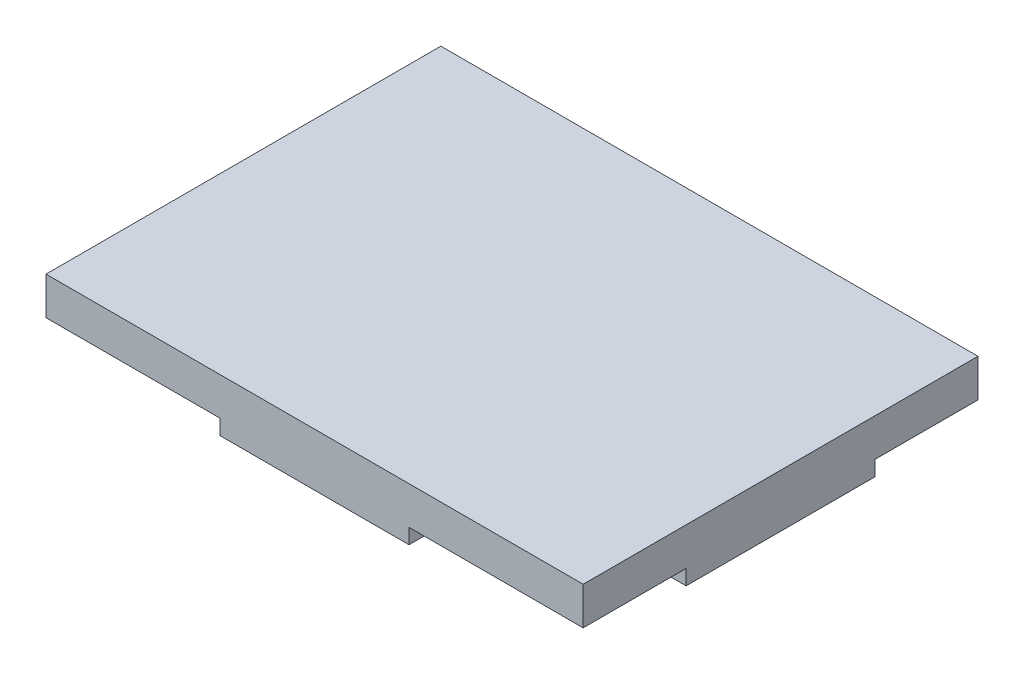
ISO-10303-21;
HEADER;
FILE_DESCRIPTION(('STEP AP214'),'2;1');
FILE_NAME('part.step','',(''),(''),'','','');
FILE_SCHEMA(('AUTOMOTIVE_DESIGN { 1 0 10303 214 1 1 1 1 }'));
ENDSEC;
DATA;
#1=APPLICATION_CONTEXT('core data for automotive mechanical design processes');
#2=APPLICATION_PROTOCOL_DEFINITION('international standard','automotive_design',2000,#1);
#3=PRODUCT_CONTEXT('',#1,'mechanical');
#4=PRODUCT('Part','Part','',(#3));
#5=PRODUCT_RELATED_PRODUCT_CATEGORY('part','',(#4));
#6=PRODUCT_DEFINITION_FORMATION('','',#4);
#7=PRODUCT_DEFINITION_CONTEXT('part definition',#1,'design');
#8=PRODUCT_DEFINITION('design','',#6,#7);
#9=PRODUCT_DEFINITION_SHAPE('','',#8);
#10=(LENGTH_UNIT() NAMED_UNIT(*) SI_UNIT(.MILLI.,.METRE.));
#11=(NAMED_UNIT(*) PLANE_ANGLE_UNIT() SI_UNIT($,.RADIAN.));
#12=(NAMED_UNIT(*) SI_UNIT($,.STERADIAN.) SOLID_ANGLE_UNIT());
#13=UNCERTAINTY_MEASURE_WITH_UNIT(LENGTH_MEASURE(1.E-05),#10,'distance_accuracy_value','');
#14=(GEOMETRIC_REPRESENTATION_CONTEXT(3) GLOBAL_UNCERTAINTY_ASSIGNED_CONTEXT((#13)) GLOBAL_UNIT_ASSIGNED_CONTEXT((#10,
#11,#12)) REPRESENTATION_CONTEXT('',''));
#15=CARTESIAN_POINT('',(0.,0.,0.));
#16=DIRECTION('',(0.,0.,1.));
#17=DIRECTION('',(1.,0.,0.));
#18=AXIS2_PLACEMENT_3D('',#15,#16,#17);
#19=CARTESIAN_POINT('',(0.,5.,0.));
#20=DIRECTION('',(0.,1.,0.));
#21=DIRECTION('',(0.,0.,1.));
#22=AXIS2_PLACEMENT_3D('',#19,#20,#21);
#23=PLANE('',#22);
#24=DIRECTION('',(0.,0.,1.));
#25=VECTOR('',#24,1.);
#26=CARTESIAN_POINT('',(-35.5445222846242,5.,-26.128187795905));
#27=LINE('',#26,#25);
#28=CARTESIAN_POINT('',(-35.5445222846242,5.,-26.128187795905));
#29=VERTEX_POINT('',#28);
#30=CARTESIAN_POINT('',(-35.5445222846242,5.,26.128187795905));
#31=VERTEX_POINT('',#30);
#32=EDGE_CURVE('E858',#29,#31,#27,.T.);
#33=ORIENTED_EDGE('',*,*,#32,.T.);
#34=DIRECTION('',(1.,0.,0.));
#35=VECTOR('',#34,1.);
#36=CARTESIAN_POINT('',(-35.5445222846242,5.,26.128187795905));
#37=LINE('',#36,#35);
#38=CARTESIAN_POINT('',(35.5445222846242,5.,26.128187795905));
#39=VERTEX_POINT('',#38);
#40=EDGE_CURVE('E861',#31,#39,#37,.T.);
#41=ORIENTED_EDGE('',*,*,#40,.T.);
#42=DIRECTION('',(0.,0.,-1.));
#43=VECTOR('',#42,1.);
#44=CARTESIAN_POINT('',(35.5445222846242,5.,-26.128187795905));
#45=LINE('',#44,#43);
#46=CARTESIAN_POINT('',(35.5445222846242,5.,-26.128187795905));
#47=VERTEX_POINT('',#46);
#48=EDGE_CURVE('E864',#39,#47,#45,.T.);
#49=ORIENTED_EDGE('',*,*,#48,.T.);
#50=DIRECTION('',(-1.,0.,0.));
#51=VECTOR('',#50,1.);
#52=CARTESIAN_POINT('',(-35.5445222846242,5.,-26.128187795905));
#53=LINE('',#52,#51);
#54=EDGE_CURVE('E867',#47,#29,#53,.T.);
#55=ORIENTED_EDGE('',*,*,#54,.T.);
#56=EDGE_LOOP('',(#33,#41,#49,#55));
#57=FACE_BOUND('',#56,.T.);
#58=ADVANCED_FACE('F158',(#57),#23,.T.);
#59=CARTESIAN_POINT('',(-35.5445222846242,-39.3970186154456,26.128187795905));
#60=DIRECTION('',(0.,0.,1.));
#61=DIRECTION('',(1.,0.,0.));
#62=AXIS2_PLACEMENT_3D('',#59,#60,#61);
#63=PLANE('',#62);
#64=DIRECTION('',(0.,1.,0.));
#65=VECTOR('',#64,1.);
#66=CARTESIAN_POINT('',(-35.5445222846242,-39.3970186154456,26.128187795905));
#67=LINE('',#66,#65);
#68=CARTESIAN_POINT('',(-35.5445222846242,0.,26.128187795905));
#69=VERTEX_POINT('',#68);
#70=EDGE_CURVE('E870',#69,#31,#67,.T.);
#71=ORIENTED_EDGE('',*,*,#70,.F.);
#72=DIRECTION('',(1.,0.,0.));
#73=VECTOR('',#72,1.);
#74=CARTESIAN_POINT('',(-35.5445222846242,0.,26.128187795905));
#75=LINE('',#74,#73);
#76=CARTESIAN_POINT('',(-12.5,0.,26.128187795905));
#77=VERTEX_POINT('',#76);
#78=EDGE_CURVE('E893',#69,#77,#75,.T.);
#79=ORIENTED_EDGE('',*,*,#78,.T.);
#80=DIRECTION('',(0.,-1.,0.));
#81=VECTOR('',#80,1.);
#82=CARTESIAN_POINT('',(-12.5,-39.3970186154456,26.128187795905));
#83=LINE('',#82,#81);
#84=CARTESIAN_POINT('',(-12.5,-2.,26.128187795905));
#85=VERTEX_POINT('',#84);
#86=EDGE_CURVE('E890',#77,#85,#83,.T.);
#87=ORIENTED_EDGE('',*,*,#86,.T.);
#88=DIRECTION('',(1.,0.,0.));
#89=VECTOR('',#88,1.);
#90=CARTESIAN_POINT('',(-35.5445222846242,-2.,26.128187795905));
#91=LINE('',#90,#89);
#92=CARTESIAN_POINT('',(12.5,-2.,26.128187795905));
#93=VERTEX_POINT('',#92);
#94=EDGE_CURVE('E888',#85,#93,#91,.T.);
#95=ORIENTED_EDGE('',*,*,#94,.T.);
#96=DIRECTION('',(0.,1.,0.));
#97=VECTOR('',#96,1.);
#98=CARTESIAN_POINT('',(12.5,-39.3970186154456,26.128187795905));
#99=LINE('',#98,#97);
#100=CARTESIAN_POINT('',(12.5,0.,26.128187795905));
#101=VERTEX_POINT('',#100);
#102=EDGE_CURVE('E603',#93,#101,#99,.T.);
#103=ORIENTED_EDGE('',*,*,#102,.T.);
#104=DIRECTION('',(1.,0.,0.));
#105=VECTOR('',#104,1.);
#106=CARTESIAN_POINT('',(-35.5445222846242,0.,26.128187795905));
#107=LINE('',#106,#105);
#108=CARTESIAN_POINT('',(35.5445222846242,0.,26.128187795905));
#109=VERTEX_POINT('',#108);
#110=EDGE_CURVE('E874',#101,#109,#107,.T.);
#111=ORIENTED_EDGE('',*,*,#110,.T.);
#112=DIRECTION('',(0.,1.,0.));
#113=VECTOR('',#112,1.);
#114=CARTESIAN_POINT('',(35.5445222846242,-39.3970186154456,26.128187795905));
#115=LINE('',#114,#113);
#116=EDGE_CURVE('E878',#109,#39,#115,.T.);
#117=ORIENTED_EDGE('',*,*,#116,.T.);
#118=ORIENTED_EDGE('',*,*,#40,.F.);
#119=EDGE_LOOP('',(#71,#79,#87,#95,#103,#111,#117,#118));
#120=FACE_BOUND('',#119,.T.);
#121=ADVANCED_FACE('F1169',(#120),#63,.T.);
#122=CARTESIAN_POINT('',(35.5445222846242,-39.3970186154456,-26.128187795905));
#123=DIRECTION('',(1.,0.,0.));
#124=DIRECTION('',(0.,0.,-1.));
#125=AXIS2_PLACEMENT_3D('',#122,#123,#124);
#126=PLANE('',#125);
#127=DIRECTION('',(0.,1.,0.));
#128=VECTOR('',#127,1.);
#129=CARTESIAN_POINT('',(35.5445222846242,-39.3970186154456,-12.5));
#130=LINE('',#129,#128);
#131=CARTESIAN_POINT('',(35.5445222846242,-1.99999999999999,-12.5));
#132=VERTEX_POINT('',#131);
#133=CARTESIAN_POINT('',(35.5445222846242,0.,-12.5));
#134=VERTEX_POINT('',#133);
#135=EDGE_CURVE('E903',#132,#134,#130,.T.);
#136=ORIENTED_EDGE('',*,*,#135,.T.);
#137=DIRECTION('',(0.,0.,-1.));
#138=VECTOR('',#137,1.);
#139=CARTESIAN_POINT('',(35.5445222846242,0.,-26.128187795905));
#140=LINE('',#139,#138);
#141=CARTESIAN_POINT('',(35.5445222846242,0.,-26.128187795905));
#142=VERTEX_POINT('',#141);
#143=EDGE_CURVE('E418',#134,#142,#140,.T.);
#144=ORIENTED_EDGE('',*,*,#143,.T.);
#145=DIRECTION('',(0.,1.,0.));
#146=VECTOR('',#145,1.);
#147=CARTESIAN_POINT('',(35.5445222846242,-39.3970186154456,-26.128187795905));
#148=LINE('',#147,#146);
#149=EDGE_CURVE('E875',#142,#47,#148,.T.);
#150=ORIENTED_EDGE('',*,*,#149,.T.);
#151=ORIENTED_EDGE('',*,*,#48,.F.);
#152=ORIENTED_EDGE('',*,*,#116,.F.);
#153=DIRECTION('',(0.,0.,-1.));
#154=VECTOR('',#153,1.);
#155=CARTESIAN_POINT('',(35.5445222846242,0.,-26.128187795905));
#156=LINE('',#155,#154);
#157=CARTESIAN_POINT('',(35.5445222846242,0.,12.5));
#158=VERTEX_POINT('',#157);
#159=EDGE_CURVE('E885',#109,#158,#156,.T.);
#160=ORIENTED_EDGE('',*,*,#159,.T.);
#161=DIRECTION('',(0.,-1.,0.));
#162=VECTOR('',#161,1.);
#163=CARTESIAN_POINT('',(35.5445222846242,-39.3970186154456,12.5));
#164=LINE('',#163,#162);
#165=CARTESIAN_POINT('',(35.5445222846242,-1.99999999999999,12.5));
#166=VERTEX_POINT('',#165);
#167=EDGE_CURVE('E897',#158,#166,#164,.T.);
#168=ORIENTED_EDGE('',*,*,#167,.T.);
#169=DIRECTION('',(0.,0.,-1.));
#170=VECTOR('',#169,1.);
#171=CARTESIAN_POINT('',(35.5445222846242,-1.99999999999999,-26.128187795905));
#172=LINE('',#171,#170);
#173=EDGE_CURVE('E900',#166,#132,#172,.T.);
#174=ORIENTED_EDGE('',*,*,#173,.T.);
#175=EDGE_LOOP('',(#136,#144,#150,#151,#152,#160,#168,#174));
#176=FACE_BOUND('',#175,.T.);
#177=ADVANCED_FACE('F1279',(#176),#126,.T.);
#178=CARTESIAN_POINT('',(-35.5445222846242,-39.3970186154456,-26.128187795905));
#179=DIRECTION('',(0.,0.,-1.));
#180=DIRECTION('',(-1.,0.,0.));
#181=AXIS2_PLACEMENT_3D('',#178,#179,#180);
#182=PLANE('',#181);
#183=DIRECTION('',(0.,1.,0.));
#184=VECTOR('',#183,1.);
#185=CARTESIAN_POINT('',(-12.5,-39.3970186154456,-26.128187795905));
#186=LINE('',#185,#184);
#187=CARTESIAN_POINT('',(-12.5,-2.,-26.128187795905));
#188=VERTEX_POINT('',#187);
#189=CARTESIAN_POINT('',(-12.5,0.,-26.128187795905));
#190=VERTEX_POINT('',#189);
#191=EDGE_CURVE('E913',#188,#190,#186,.T.);
#192=ORIENTED_EDGE('',*,*,#191,.T.);
#193=DIRECTION('',(-1.,0.,0.));
#194=VECTOR('',#193,1.);
#195=CARTESIAN_POINT('',(-35.5445222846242,0.,-26.128187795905));
#196=LINE('',#195,#194);
#197=CARTESIAN_POINT('',(-35.5445222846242,0.,-26.128187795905));
#198=VERTEX_POINT('',#197);
#199=EDGE_CURVE('E857',#190,#198,#196,.T.);
#200=ORIENTED_EDGE('',*,*,#199,.T.);
#201=DIRECTION('',(0.,1.,0.));
#202=VECTOR('',#201,1.);
#203=CARTESIAN_POINT('',(-35.5445222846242,-39.3970186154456,-26.128187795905));
#204=LINE('',#203,#202);
#205=EDGE_CURVE('E871',#198,#29,#204,.T.);
#206=ORIENTED_EDGE('',*,*,#205,.T.);
#207=ORIENTED_EDGE('',*,*,#54,.F.);
#208=ORIENTED_EDGE('',*,*,#149,.F.);
#209=DIRECTION('',(-1.,0.,0.));
#210=VECTOR('',#209,1.);
#211=CARTESIAN_POINT('',(-35.5445222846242,0.,-26.128187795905));
#212=LINE('',#211,#210);
#213=CARTESIAN_POINT('',(12.5,0.,-26.128187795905));
#214=VERTEX_POINT('',#213);
#215=EDGE_CURVE('E906',#142,#214,#212,.T.);
#216=ORIENTED_EDGE('',*,*,#215,.T.);
#217=DIRECTION('',(0.,-1.,0.));
#218=VECTOR('',#217,1.);
#219=CARTESIAN_POINT('',(12.5,-39.3970186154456,-26.128187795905));
#220=LINE('',#219,#218);
#221=CARTESIAN_POINT('',(12.5,-2.,-26.128187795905));
#222=VERTEX_POINT('',#221);
#223=EDGE_CURVE('E907',#214,#222,#220,.T.);
#224=ORIENTED_EDGE('',*,*,#223,.T.);
#225=DIRECTION('',(-1.,0.,0.));
#226=VECTOR('',#225,1.);
#227=CARTESIAN_POINT('',(-35.5445222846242,-2.,-26.128187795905));
#228=LINE('',#227,#226);
#229=EDGE_CURVE('E910',#222,#188,#228,.T.);
#230=ORIENTED_EDGE('',*,*,#229,.T.);
#231=EDGE_LOOP('',(#192,#200,#206,#207,#208,#216,#224,#230));
#232=FACE_BOUND('',#231,.T.);
#233=ADVANCED_FACE('F1176',(#232),#182,.T.);
#234=CARTESIAN_POINT('',(-35.5445222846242,-39.3970186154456,-26.128187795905));
#235=DIRECTION('',(-1.,0.,0.));
#236=DIRECTION('',(0.,0.,1.));
#237=AXIS2_PLACEMENT_3D('',#234,#235,#236);
#238=PLANE('',#237);
#239=ORIENTED_EDGE('',*,*,#205,.F.);
#240=DIRECTION('',(0.,0.,1.));
#241=VECTOR('',#240,1.);
#242=CARTESIAN_POINT('',(-35.5445222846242,0.,-26.128187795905));
#243=LINE('',#242,#241);
#244=CARTESIAN_POINT('',(-35.5445222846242,0.,-12.5));
#245=VERTEX_POINT('',#244);
#246=EDGE_CURVE('E854',#198,#245,#243,.T.);
#247=ORIENTED_EDGE('',*,*,#246,.T.);
#248=DIRECTION('',(0.,-1.,0.));
#249=VECTOR('',#248,1.);
#250=CARTESIAN_POINT('',(-35.5445222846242,-39.3970186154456,-12.5));
#251=LINE('',#250,#249);
#252=CARTESIAN_POINT('',(-35.5445222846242,-1.99999999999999,-12.5));
#253=VERTEX_POINT('',#252);
#254=EDGE_CURVE('E162',#245,#253,#251,.T.);
#255=ORIENTED_EDGE('',*,*,#254,.T.);
#256=DIRECTION('',(0.,0.,1.));
#257=VECTOR('',#256,1.);
#258=CARTESIAN_POINT('',(-35.5445222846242,-1.99999999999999,-26.128187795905));
#259=LINE('',#258,#257);
#260=CARTESIAN_POINT('',(-35.5445222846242,-1.99999999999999,12.5));
#261=VERTEX_POINT('',#260);
#262=EDGE_CURVE('E920',#253,#261,#259,.T.);
#263=ORIENTED_EDGE('',*,*,#262,.T.);
#264=DIRECTION('',(0.,1.,0.));
#265=VECTOR('',#264,1.);
#266=CARTESIAN_POINT('',(-35.5445222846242,-39.3970186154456,12.5));
#267=LINE('',#266,#265);
#268=CARTESIAN_POINT('',(-35.5445222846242,0.,12.5));
#269=VERTEX_POINT('',#268);
#270=EDGE_CURVE('E918',#261,#269,#267,.T.);
#271=ORIENTED_EDGE('',*,*,#270,.T.);
#272=DIRECTION('',(0.,0.,1.));
#273=VECTOR('',#272,1.);
#274=CARTESIAN_POINT('',(-35.5445222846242,0.,-26.128187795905));
#275=LINE('',#274,#273);
#276=EDGE_CURVE('E896',#269,#69,#275,.T.);
#277=ORIENTED_EDGE('',*,*,#276,.T.);
#278=ORIENTED_EDGE('',*,*,#70,.T.);
#279=ORIENTED_EDGE('',*,*,#32,.F.);
#280=EDGE_LOOP('',(#239,#247,#255,#263,#271,#277,#278,#279));
#281=FACE_BOUND('',#280,.T.);
#282=ADVANCED_FACE('F160',(#281),#238,.T.);
#283=CARTESIAN_POINT('',(-22.5,0.,-15.));
#284=DIRECTION('',(0.,1.,0.));
#285=DIRECTION('',(0.,0.,1.));
#286=AXIS2_PLACEMENT_3D('',#283,#284,#285);
#287=CYLINDRICAL_SURFACE('',#286,1.5);
#288=CARTESIAN_POINT('',(-22.5,0.,-15.));
#289=DIRECTION('',(0.,-1.,0.));
#290=DIRECTION('',(1.,0.,0.));
#291=AXIS2_PLACEMENT_3D('',#288,#289,#290);
#292=CIRCLE('',#291,1.5);
#293=CARTESIAN_POINT('',(-22.5,0.,-16.5));
#294=VERTEX_POINT('',#293);
#295=CARTESIAN_POINT('',(-24.,0.,-15.));
#296=VERTEX_POINT('',#295);
#297=EDGE_CURVE('E887',#294,#296,#292,.F.);
#298=ORIENTED_EDGE('',*,*,#297,.F.);
#299=DIRECTION('',(0.,1.,0.));
#300=VECTOR('',#299,1.);
#301=CARTESIAN_POINT('',(-22.5,-5.,-16.5));
#302=LINE('',#301,#300);
#303=CARTESIAN_POINT('',(-22.5,-5.,-16.5));
#304=VERTEX_POINT('',#303);
#305=EDGE_CURVE('E795',#304,#294,#302,.T.);
#306=ORIENTED_EDGE('',*,*,#305,.F.);
#307=CARTESIAN_POINT('',(-22.5,-5.,-15.));
#308=DIRECTION('',(0.,1.,0.));
#309=DIRECTION('',(0.,0.,1.));
#310=AXIS2_PLACEMENT_3D('',#307,#308,#309);
#311=CIRCLE('',#310,1.5);
#312=CARTESIAN_POINT('',(-24.,-5.,-15.));
#313=VERTEX_POINT('',#312);
#314=EDGE_CURVE('E792',#304,#313,#311,.T.);
#315=ORIENTED_EDGE('',*,*,#314,.T.);
#316=DIRECTION('',(0.,1.,0.));
#317=VECTOR('',#316,1.);
#318=CARTESIAN_POINT('',(-24.,0.,-15.));
#319=LINE('',#318,#317);
#320=EDGE_CURVE('E796',#296,#313,#319,.F.);
#321=ORIENTED_EDGE('',*,*,#320,.F.);
#322=EDGE_LOOP('',(#298,#306,#315,#321));
#323=FACE_BOUND('',#322,.T.);
#324=ADVANCED_FACE('F1265',(#323),#287,.T.);
#325=CARTESIAN_POINT('',(22.5,0.,-15.));
#326=DIRECTION('',(0.,-1.,0.));
#327=DIRECTION('',(0.,0.,-1.));
#328=AXIS2_PLACEMENT_3D('',#325,#326,#327);
#329=CYLINDRICAL_SURFACE('',#328,1.5);
#330=CARTESIAN_POINT('',(22.5,0.,-15.));
#331=DIRECTION('',(0.,-1.,0.));
#332=DIRECTION('',(1.,0.,0.));
#333=AXIS2_PLACEMENT_3D('',#330,#331,#332);
#334=CIRCLE('',#333,1.5);
#335=CARTESIAN_POINT('',(24.,0.,-15.));
#336=VERTEX_POINT('',#335);
#337=CARTESIAN_POINT('',(22.5,0.,-16.5));
#338=VERTEX_POINT('',#337);
#339=EDGE_CURVE('E587',#336,#338,#334,.F.);
#340=ORIENTED_EDGE('',*,*,#339,.F.);
#341=DIRECTION('',(0.,1.,0.));
#342=VECTOR('',#341,1.);
#343=CARTESIAN_POINT('',(24.,0.,-15.));
#344=LINE('',#343,#342);
#345=CARTESIAN_POINT('',(24.,-4.99999999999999,-15.));
#346=VERTEX_POINT('',#345);
#347=EDGE_CURVE('E815',#346,#336,#344,.T.);
#348=ORIENTED_EDGE('',*,*,#347,.F.);
#349=CARTESIAN_POINT('',(22.5,-4.99999999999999,-15.));
#350=DIRECTION('',(0.,1.,0.));
#351=DIRECTION('',(-1.,0.,0.));
#352=AXIS2_PLACEMENT_3D('',#349,#350,#351);
#353=CIRCLE('',#352,1.5);
#354=CARTESIAN_POINT('',(22.5,-4.99999999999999,-16.5));
#355=VERTEX_POINT('',#354);
#356=EDGE_CURVE('E812',#355,#346,#353,.F.);
#357=ORIENTED_EDGE('',*,*,#356,.F.);
#358=DIRECTION('',(0.,1.,0.));
#359=VECTOR('',#358,1.);
#360=CARTESIAN_POINT('',(22.5,-5.,-16.5));
#361=LINE('',#360,#359);
#362=EDGE_CURVE('E480',#338,#355,#361,.F.);
#363=ORIENTED_EDGE('',*,*,#362,.F.);
#364=EDGE_LOOP('',(#340,#348,#357,#363));
#365=FACE_BOUND('',#364,.T.);
#366=ADVANCED_FACE('F1236',(#365),#329,.T.);
#367=CARTESIAN_POINT('',(20.,-5.,-15.));
#368=DIRECTION('',(0.,0.,-1.));
#369=DIRECTION('',(-1.,0.,0.));
#370=AXIS2_PLACEMENT_3D('',#367,#368,#369);
#371=TOROIDAL_SURFACE('',#370,2.5,1.5);
#372=ORIENTED_EDGE('',*,*,#356,.T.);
#373=CARTESIAN_POINT('',(20.,-5.,-15.));
#374=DIRECTION('',(0.,0.,-1.));
#375=DIRECTION('',(-1.,0.,0.));
#376=AXIS2_PLACEMENT_3D('',#373,#374,#375);
#377=CIRCLE('',#376,4.);
#378=CARTESIAN_POINT('',(16.9230769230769,-7.55588426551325,-15.));
#379=VERTEX_POINT('',#378);
#380=EDGE_CURVE('E695',#379,#346,#377,.F.);
#381=ORIENTED_EDGE('',*,*,#380,.F.);
#382=CARTESIAN_POINT('',(18.0769230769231,-6.59742766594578,-15.));
#383=DIRECTION('',(-0.638971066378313,0.76923076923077,0.));
#384=DIRECTION('',(-0.76923076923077,-0.638971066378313,0.));
#385=AXIS2_PLACEMENT_3D('',#382,#383,#384);
#386=CIRCLE('',#385,1.5);
#387=CARTESIAN_POINT('',(18.0769230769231,-6.59742766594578,-16.5));
#388=VERTEX_POINT('',#387);
#389=EDGE_CURVE('E699',#388,#379,#386,.T.);
#390=ORIENTED_EDGE('',*,*,#389,.F.);
#391=CARTESIAN_POINT('',(20.,-5.,-16.5));
#392=DIRECTION('',(0.,0.,-1.));
#393=DIRECTION('',(-1.,0.,0.));
#394=AXIS2_PLACEMENT_3D('',#391,#392,#393);
#395=CIRCLE('',#394,2.5);
#396=EDGE_CURVE('E811',#355,#388,#395,.T.);
#397=ORIENTED_EDGE('',*,*,#396,.F.);
#398=EDGE_LOOP('',(#372,#381,#390,#397));
#399=FACE_BOUND('',#398,.T.);
#400=ADVANCED_FACE('F1244',(#399),#371,.T.);
#401=CARTESIAN_POINT('',(15.,-9.15331193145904,-15.));
#402=DIRECTION('',(0.,0.,-1.));
#403=DIRECTION('',(-1.,0.,0.));
#404=AXIS2_PLACEMENT_3D('',#401,#402,#403);
#405=TOROIDAL_SURFACE('',#404,4.,1.5);
#406=ORIENTED_EDGE('',*,*,#389,.T.);
#407=CARTESIAN_POINT('',(15.,-9.15331193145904,-15.));
#408=DIRECTION('',(0.,0.,-1.));
#409=DIRECTION('',(-1.,0.,0.));
#410=AXIS2_PLACEMENT_3D('',#407,#408,#409);
#411=CIRCLE('',#410,2.5);
#412=CARTESIAN_POINT('',(13.0769230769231,-7.55588426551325,-15.));
#413=VERTEX_POINT('',#412);
#414=EDGE_CURVE('E705',#413,#379,#411,.T.);
#415=ORIENTED_EDGE('',*,*,#414,.F.);
#416=CARTESIAN_POINT('',(11.9230769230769,-6.59742766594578,-15.));
#417=DIRECTION('',(0.638971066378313,0.76923076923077,0.));
#418=DIRECTION('',(-0.76923076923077,0.638971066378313,0.));
#419=AXIS2_PLACEMENT_3D('',#416,#417,#418);
#420=CIRCLE('',#419,1.5);
#421=CARTESIAN_POINT('',(11.9230769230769,-6.59742766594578,-16.5));
#422=VERTEX_POINT('',#421);
#423=EDGE_CURVE('E709',#422,#413,#420,.F.);
#424=ORIENTED_EDGE('',*,*,#423,.F.);
#425=CARTESIAN_POINT('',(15.,-9.15331193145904,-16.5));
#426=DIRECTION('',(0.,0.,-1.));
#427=DIRECTION('',(-1.,0.,0.));
#428=AXIS2_PLACEMENT_3D('',#425,#426,#427);
#429=CIRCLE('',#428,4.);
#430=EDGE_CURVE('E698',#388,#422,#429,.F.);
#431=ORIENTED_EDGE('',*,*,#430,.F.);
#432=EDGE_LOOP('',(#406,#415,#424,#431));
#433=FACE_BOUND('',#432,.T.);
#434=ADVANCED_FACE('F1247',(#433),#405,.T.);
#435=CARTESIAN_POINT('',(10.,-5.,-15.));
#436=DIRECTION('',(0.,0.,-1.));
#437=DIRECTION('',(-1.,0.,0.));
#438=AXIS2_PLACEMENT_3D('',#435,#436,#437);
#439=TOROIDAL_SURFACE('',#438,2.5,1.5);
#440=ORIENTED_EDGE('',*,*,#423,.T.);
#441=CARTESIAN_POINT('',(10.,-5.,-15.));
#442=DIRECTION('',(0.,0.,-1.));
#443=DIRECTION('',(-1.,0.,0.));
#444=AXIS2_PLACEMENT_3D('',#441,#442,#443);
#445=CIRCLE('',#444,4.);
#446=CARTESIAN_POINT('',(6.92307692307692,-7.55588426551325,-15.));
#447=VERTEX_POINT('',#446);
#448=EDGE_CURVE('E715',#447,#413,#445,.F.);
#449=ORIENTED_EDGE('',*,*,#448,.F.);
#450=CARTESIAN_POINT('',(8.07692307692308,-6.59742766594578,-15.));
#451=DIRECTION('',(-0.638971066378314,0.769230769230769,0.));
#452=DIRECTION('',(-0.769230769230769,-0.638971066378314,0.));
#453=AXIS2_PLACEMENT_3D('',#450,#451,#452);
#454=CIRCLE('',#453,1.5);
#455=CARTESIAN_POINT('',(8.07692307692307,-6.59742766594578,-16.5));
#456=VERTEX_POINT('',#455);
#457=EDGE_CURVE('E719',#456,#447,#454,.T.);
#458=ORIENTED_EDGE('',*,*,#457,.F.);
#459=CARTESIAN_POINT('',(10.,-5.,-16.5));
#460=DIRECTION('',(0.,0.,-1.));
#461=DIRECTION('',(-1.,0.,0.));
#462=AXIS2_PLACEMENT_3D('',#459,#460,#461);
#463=CIRCLE('',#462,2.5);
#464=EDGE_CURVE('E708',#422,#456,#463,.T.);
#465=ORIENTED_EDGE('',*,*,#464,.F.);
#466=EDGE_LOOP('',(#440,#449,#458,#465));
#467=FACE_BOUND('',#466,.T.);
#468=ADVANCED_FACE('F1438',(#467),#439,.T.);
#469=CARTESIAN_POINT('',(5.,-9.15331193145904,-15.));
#470=DIRECTION('',(0.,0.,-1.));
#471=DIRECTION('',(-1.,0.,0.));
#472=AXIS2_PLACEMENT_3D('',#469,#470,#471);
#473=TOROIDAL_SURFACE('',#472,4.,1.5);
#474=ORIENTED_EDGE('',*,*,#457,.T.);
#475=CARTESIAN_POINT('',(5.,-9.15331193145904,-15.));
#476=DIRECTION('',(0.,0.,-1.));
#477=DIRECTION('',(-1.,0.,0.));
#478=AXIS2_PLACEMENT_3D('',#475,#476,#477);
#479=CIRCLE('',#478,2.5);
#480=CARTESIAN_POINT('',(3.07692307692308,-7.55588426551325,-15.));
#481=VERTEX_POINT('',#480);
#482=EDGE_CURVE('E725',#481,#447,#479,.T.);
#483=ORIENTED_EDGE('',*,*,#482,.F.);
#484=CARTESIAN_POINT('',(1.92307692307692,-6.59742766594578,-15.));
#485=DIRECTION('',(0.638971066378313,0.769230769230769,0.));
#486=DIRECTION('',(-0.769230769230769,0.638971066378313,0.));
#487=AXIS2_PLACEMENT_3D('',#484,#485,#486);
#488=CIRCLE('',#487,1.5);
#489=CARTESIAN_POINT('',(1.92307692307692,-6.59742766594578,-16.5));
#490=VERTEX_POINT('',#489);
#491=EDGE_CURVE('E729',#490,#481,#488,.F.);
#492=ORIENTED_EDGE('',*,*,#491,.F.);
#493=CARTESIAN_POINT('',(5.,-9.15331193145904,-16.5));
#494=DIRECTION('',(0.,0.,-1.));
#495=DIRECTION('',(-1.,0.,0.));
#496=AXIS2_PLACEMENT_3D('',#493,#494,#495);
#497=CIRCLE('',#496,4.);
#498=EDGE_CURVE('E718',#456,#490,#497,.F.);
#499=ORIENTED_EDGE('',*,*,#498,.F.);
#500=EDGE_LOOP('',(#474,#483,#492,#499));
#501=FACE_BOUND('',#500,.T.);
#502=ADVANCED_FACE('F1435',(#501),#473,.T.);
#503=CARTESIAN_POINT('',(0.,-5.,-15.));
#504=DIRECTION('',(0.,0.,-1.));
#505=DIRECTION('',(-1.,0.,0.));
#506=AXIS2_PLACEMENT_3D('',#503,#504,#505);
#507=TOROIDAL_SURFACE('',#506,2.5,1.5);
#508=ORIENTED_EDGE('',*,*,#491,.T.);
#509=CARTESIAN_POINT('',(0.,-5.,-15.));
#510=DIRECTION('',(0.,0.,-1.));
#511=DIRECTION('',(-1.,0.,0.));
#512=AXIS2_PLACEMENT_3D('',#509,#510,#511);
#513=CIRCLE('',#512,4.);
#514=CARTESIAN_POINT('',(-3.07692307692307,-7.55588426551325,-15.));
#515=VERTEX_POINT('',#514);
#516=EDGE_CURVE('E735',#515,#481,#513,.F.);
#517=ORIENTED_EDGE('',*,*,#516,.F.);
#518=CARTESIAN_POINT('',(-1.92307692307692,-6.59742766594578,-15.));
#519=DIRECTION('',(-0.638971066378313,0.76923076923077,0.));
#520=DIRECTION('',(-0.76923076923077,-0.638971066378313,0.));
#521=AXIS2_PLACEMENT_3D('',#518,#519,#520);
#522=CIRCLE('',#521,1.5);
#523=CARTESIAN_POINT('',(-1.92307692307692,-6.59742766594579,-16.5));
#524=VERTEX_POINT('',#523);
#525=EDGE_CURVE('E739',#524,#515,#522,.T.);
#526=ORIENTED_EDGE('',*,*,#525,.F.);
#527=CARTESIAN_POINT('',(0.,-5.,-16.5));
#528=DIRECTION('',(0.,0.,-1.));
#529=DIRECTION('',(-1.,0.,0.));
#530=AXIS2_PLACEMENT_3D('',#527,#528,#529);
#531=CIRCLE('',#530,2.5);
#532=EDGE_CURVE('E728',#490,#524,#531,.T.);
#533=ORIENTED_EDGE('',*,*,#532,.F.);
#534=EDGE_LOOP('',(#508,#517,#526,#533));
#535=FACE_BOUND('',#534,.T.);
#536=ADVANCED_FACE('F1432',(#535),#507,.T.);
#537=CARTESIAN_POINT('',(-5.,-9.15331193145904,-15.));
#538=DIRECTION('',(0.,0.,-1.));
#539=DIRECTION('',(-1.,0.,0.));
#540=AXIS2_PLACEMENT_3D('',#537,#538,#539);
#541=TOROIDAL_SURFACE('',#540,4.,1.5);
#542=ORIENTED_EDGE('',*,*,#525,.T.);
#543=CARTESIAN_POINT('',(-5.,-9.15331193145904,-15.));
#544=DIRECTION('',(0.,0.,-1.));
#545=DIRECTION('',(-1.,0.,0.));
#546=AXIS2_PLACEMENT_3D('',#543,#544,#545);
#547=CIRCLE('',#546,2.5);
#548=CARTESIAN_POINT('',(-6.92307692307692,-7.55588426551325,-15.));
#549=VERTEX_POINT('',#548);
#550=EDGE_CURVE('E745',#549,#515,#547,.T.);
#551=ORIENTED_EDGE('',*,*,#550,.F.);
#552=CARTESIAN_POINT('',(-8.07692307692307,-6.59742766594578,-15.));
#553=DIRECTION('',(0.638971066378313,0.76923076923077,0.));
#554=DIRECTION('',(-0.76923076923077,0.638971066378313,0.));
#555=AXIS2_PLACEMENT_3D('',#552,#553,#554);
#556=CIRCLE('',#555,1.5);
#557=CARTESIAN_POINT('',(-8.07692307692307,-6.59742766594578,-16.5));
#558=VERTEX_POINT('',#557);
#559=EDGE_CURVE('E749',#558,#549,#556,.F.);
#560=ORIENTED_EDGE('',*,*,#559,.F.);
#561=CARTESIAN_POINT('',(-5.,-9.15331193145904,-16.5));
#562=DIRECTION('',(0.,0.,-1.));
#563=DIRECTION('',(-1.,0.,0.));
#564=AXIS2_PLACEMENT_3D('',#561,#562,#563);
#565=CIRCLE('',#564,4.);
#566=EDGE_CURVE('E738',#524,#558,#565,.F.);
#567=ORIENTED_EDGE('',*,*,#566,.F.);
#568=EDGE_LOOP('',(#542,#551,#560,#567));
#569=FACE_BOUND('',#568,.T.);
#570=ADVANCED_FACE('F1429',(#569),#541,.T.);
#571=CARTESIAN_POINT('',(-10.,-5.,-15.));
#572=DIRECTION('',(0.,0.,-1.));
#573=DIRECTION('',(-1.,0.,0.));
#574=AXIS2_PLACEMENT_3D('',#571,#572,#573);
#575=TOROIDAL_SURFACE('',#574,2.5,1.5);
#576=ORIENTED_EDGE('',*,*,#559,.T.);
#577=CARTESIAN_POINT('',(-10.,-5.,-15.));
#578=DIRECTION('',(0.,0.,-1.));
#579=DIRECTION('',(-1.,0.,0.));
#580=AXIS2_PLACEMENT_3D('',#577,#578,#579);
#581=CIRCLE('',#580,4.);
#582=CARTESIAN_POINT('',(-13.0769230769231,-7.55588426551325,-15.));
#583=VERTEX_POINT('',#582);
#584=EDGE_CURVE('E755',#583,#549,#581,.F.);
#585=ORIENTED_EDGE('',*,*,#584,.F.);
#586=CARTESIAN_POINT('',(-11.9230769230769,-6.59742766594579,-15.));
#587=DIRECTION('',(-0.638971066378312,0.76923076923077,0.));
#588=DIRECTION('',(-0.76923076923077,-0.638971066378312,0.));
#589=AXIS2_PLACEMENT_3D('',#586,#587,#588);
#590=CIRCLE('',#589,1.5);
#591=CARTESIAN_POINT('',(-11.9230769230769,-6.59742766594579,-16.5));
#592=VERTEX_POINT('',#591);
#593=EDGE_CURVE('E759',#592,#583,#590,.T.);
#594=ORIENTED_EDGE('',*,*,#593,.F.);
#595=CARTESIAN_POINT('',(-10.,-5.,-16.5));
#596=DIRECTION('',(0.,0.,-1.));
#597=DIRECTION('',(-1.,0.,0.));
#598=AXIS2_PLACEMENT_3D('',#595,#596,#597);
#599=CIRCLE('',#598,2.5);
#600=EDGE_CURVE('E748',#558,#592,#599,.T.);
#601=ORIENTED_EDGE('',*,*,#600,.F.);
#602=EDGE_LOOP('',(#576,#585,#594,#601));
#603=FACE_BOUND('',#602,.T.);
#604=ADVANCED_FACE('F1427',(#603),#575,.T.);
#605=CARTESIAN_POINT('',(-15.,-9.15331193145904,-15.));
#606=DIRECTION('',(0.,0.,-1.));
#607=DIRECTION('',(-1.,0.,0.));
#608=AXIS2_PLACEMENT_3D('',#605,#606,#607);
#609=TOROIDAL_SURFACE('',#608,4.,1.5);
#610=ORIENTED_EDGE('',*,*,#593,.T.);
#611=CARTESIAN_POINT('',(-15.,-9.15331193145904,-15.));
#612=DIRECTION('',(0.,0.,-1.));
#613=DIRECTION('',(-1.,0.,0.));
#614=AXIS2_PLACEMENT_3D('',#611,#612,#613);
#615=CIRCLE('',#614,2.5);
#616=CARTESIAN_POINT('',(-16.9230769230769,-7.55588426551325,-15.));
#617=VERTEX_POINT('',#616);
#618=EDGE_CURVE('E764',#617,#583,#615,.T.);
#619=ORIENTED_EDGE('',*,*,#618,.F.);
#620=CARTESIAN_POINT('',(-18.0769230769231,-6.59742766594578,-15.));
#621=DIRECTION('',(0.638971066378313,0.76923076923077,0.));
#622=DIRECTION('',(-0.76923076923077,0.638971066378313,0.));
#623=AXIS2_PLACEMENT_3D('',#620,#621,#622);
#624=CIRCLE('',#623,1.5);
#625=CARTESIAN_POINT('',(-18.0769230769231,-6.59742766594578,-16.5));
#626=VERTEX_POINT('',#625);
#627=EDGE_CURVE('E768',#626,#617,#624,.F.);
#628=ORIENTED_EDGE('',*,*,#627,.F.);
#629=CARTESIAN_POINT('',(-15.,-9.15331193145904,-16.5));
#630=DIRECTION('',(0.,0.,-1.));
#631=DIRECTION('',(-1.,0.,0.));
#632=AXIS2_PLACEMENT_3D('',#629,#630,#631);
#633=CIRCLE('',#632,4.);
#634=EDGE_CURVE('E758',#592,#626,#633,.F.);
#635=ORIENTED_EDGE('',*,*,#634,.F.);
#636=EDGE_LOOP('',(#610,#619,#628,#635));
#637=FACE_BOUND('',#636,.T.);
#638=ADVANCED_FACE('F1440',(#637),#609,.T.);
#639=CARTESIAN_POINT('',(-20.,-5.,-15.));
#640=DIRECTION('',(0.,0.,-1.));
#641=DIRECTION('',(-1.,0.,0.));
#642=AXIS2_PLACEMENT_3D('',#639,#640,#641);
#643=TOROIDAL_SURFACE('',#642,2.5,1.5);
#644=ORIENTED_EDGE('',*,*,#627,.T.);
#645=CARTESIAN_POINT('',(-20.,-5.,-15.));
#646=DIRECTION('',(0.,0.,-1.));
#647=DIRECTION('',(-1.,0.,0.));
#648=AXIS2_PLACEMENT_3D('',#645,#646,#647);
#649=CIRCLE('',#648,4.);
#650=EDGE_CURVE('E771',#313,#617,#649,.F.);
#651=ORIENTED_EDGE('',*,*,#650,.F.);
#652=ORIENTED_EDGE('',*,*,#314,.F.);
#653=CARTESIAN_POINT('',(-20.,-5.,-16.5));
#654=DIRECTION('',(0.,0.,-1.));
#655=DIRECTION('',(-1.,0.,0.));
#656=AXIS2_PLACEMENT_3D('',#653,#654,#655);
#657=CIRCLE('',#656,2.5);
#658=EDGE_CURVE('E767',#626,#304,#657,.T.);
#659=ORIENTED_EDGE('',*,*,#658,.F.);
#660=EDGE_LOOP('',(#644,#651,#652,#659));
#661=FACE_BOUND('',#660,.T.);
#662=ADVANCED_FACE('F1263',(#661),#643,.T.);
#663=CARTESIAN_POINT('',(-22.5,-5.,15.));
#664=DIRECTION('',(0.,-1.,0.));
#665=DIRECTION('',(0.,0.,-1.));
#666=AXIS2_PLACEMENT_3D('',#663,#664,#665);
#667=CYLINDRICAL_SURFACE('',#666,1.5);
#668=CARTESIAN_POINT('',(-22.5,0.,15.));
#669=DIRECTION('',(0.,-1.,0.));
#670=DIRECTION('',(1.,0.,0.));
#671=AXIS2_PLACEMENT_3D('',#668,#669,#670);
#672=CIRCLE('',#671,1.5);
#673=CARTESIAN_POINT('',(-24.,0.,15.));
#674=VERTEX_POINT('',#673);
#675=CARTESIAN_POINT('',(-22.5,0.,16.5));
#676=VERTEX_POINT('',#675);
#677=EDGE_CURVE('E679',#674,#676,#672,.F.);
#678=ORIENTED_EDGE('',*,*,#677,.F.);
#679=DIRECTION('',(0.,1.,0.));
#680=VECTOR('',#679,1.);
#681=CARTESIAN_POINT('',(-24.,0.,15.));
#682=LINE('',#681,#680);
#683=CARTESIAN_POINT('',(-24.,-5.,15.));
#684=VERTEX_POINT('',#683);
#685=EDGE_CURVE('E691',#684,#674,#682,.T.);
#686=ORIENTED_EDGE('',*,*,#685,.F.);
#687=CARTESIAN_POINT('',(-22.5,-5.,15.));
#688=DIRECTION('',(0.,-1.,0.));
#689=DIRECTION('',(0.,0.,-1.));
#690=AXIS2_PLACEMENT_3D('',#687,#688,#689);
#691=CIRCLE('',#690,1.5);
#692=CARTESIAN_POINT('',(-22.5,-5.,16.5));
#693=VERTEX_POINT('',#692);
#694=EDGE_CURVE('E678',#684,#693,#691,.F.);
#695=ORIENTED_EDGE('',*,*,#694,.T.);
#696=DIRECTION('',(0.,1.,0.));
#697=VECTOR('',#696,1.);
#698=CARTESIAN_POINT('',(-22.5,-5.,16.5));
#699=LINE('',#698,#697);
#700=EDGE_CURVE('E675',#676,#693,#699,.F.);
#701=ORIENTED_EDGE('',*,*,#700,.F.);
#702=EDGE_LOOP('',(#678,#686,#695,#701));
#703=FACE_BOUND('',#702,.T.);
#704=ADVANCED_FACE('F1057',(#703),#667,.T.);
#705=CARTESIAN_POINT('',(15.,-9.15331193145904,15.));
#706=DIRECTION('',(0.,0.,-1.));
#707=DIRECTION('',(-1.,0.,0.));
#708=AXIS2_PLACEMENT_3D('',#705,#706,#707);
#709=TOROIDAL_SURFACE('',#708,4.,1.5);
#710=CARTESIAN_POINT('',(18.0769230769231,-6.59742766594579,15.));
#711=DIRECTION('',(-0.638971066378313,0.76923076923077,0.));
#712=DIRECTION('',(-0.76923076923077,-0.638971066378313,0.));
#713=AXIS2_PLACEMENT_3D('',#710,#711,#712);
#714=CIRCLE('',#713,1.5);
#715=CARTESIAN_POINT('',(16.9230769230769,-7.55588426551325,15.));
#716=VERTEX_POINT('',#715);
#717=CARTESIAN_POINT('',(18.0769230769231,-6.59742766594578,16.5));
#718=VERTEX_POINT('',#717);
#719=EDGE_CURVE('E687',#716,#718,#714,.T.);
#720=ORIENTED_EDGE('',*,*,#719,.T.);
#721=CARTESIAN_POINT('',(15.,-9.15331193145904,16.5));
#722=DIRECTION('',(0.,0.,-1.));
#723=DIRECTION('',(-1.,0.,0.));
#724=AXIS2_PLACEMENT_3D('',#721,#722,#723);
#725=CIRCLE('',#724,4.);
#726=CARTESIAN_POINT('',(11.9230769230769,-6.59742766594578,16.5));
#727=VERTEX_POINT('',#726);
#728=EDGE_CURVE('E636',#727,#718,#725,.T.);
#729=ORIENTED_EDGE('',*,*,#728,.F.);
#730=CARTESIAN_POINT('',(11.9230769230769,-6.59742766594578,15.));
#731=DIRECTION('',(0.638971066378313,0.76923076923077,0.));
#732=DIRECTION('',(-0.76923076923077,0.638971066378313,0.));
#733=AXIS2_PLACEMENT_3D('',#730,#731,#732);
#734=CIRCLE('',#733,1.5);
#735=CARTESIAN_POINT('',(13.0769230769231,-7.55588426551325,15.));
#736=VERTEX_POINT('',#735);
#737=EDGE_CURVE('E640',#736,#727,#734,.F.);
#738=ORIENTED_EDGE('',*,*,#737,.F.);
#739=CARTESIAN_POINT('',(15.,-9.15331193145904,15.));
#740=DIRECTION('',(0.,0.,-1.));
#741=DIRECTION('',(-1.,0.,0.));
#742=AXIS2_PLACEMENT_3D('',#739,#740,#741);
#743=CIRCLE('',#742,2.5);
#744=EDGE_CURVE('E690',#716,#736,#743,.F.);
#745=ORIENTED_EDGE('',*,*,#744,.F.);
#746=EDGE_LOOP('',(#720,#729,#738,#745));
#747=FACE_BOUND('',#746,.T.);
#748=ADVANCED_FACE('F1390',(#747),#709,.T.);
#749=CARTESIAN_POINT('',(10.,-5.,15.));
#750=DIRECTION('',(0.,0.,-1.));
#751=DIRECTION('',(-1.,0.,0.));
#752=AXIS2_PLACEMENT_3D('',#749,#750,#751);
#753=TOROIDAL_SURFACE('',#752,2.5,1.5);
#754=ORIENTED_EDGE('',*,*,#737,.T.);
#755=CARTESIAN_POINT('',(10.,-5.,16.5));
#756=DIRECTION('',(0.,0.,-1.));
#757=DIRECTION('',(-1.,0.,0.));
#758=AXIS2_PLACEMENT_3D('',#755,#756,#757);
#759=CIRCLE('',#758,2.5);
#760=CARTESIAN_POINT('',(8.07692307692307,-6.59742766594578,16.5));
#761=VERTEX_POINT('',#760);
#762=EDGE_CURVE('E641',#761,#727,#759,.F.);
#763=ORIENTED_EDGE('',*,*,#762,.F.);
#764=CARTESIAN_POINT('',(8.07692307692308,-6.59742766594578,15.));
#765=DIRECTION('',(-0.638971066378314,0.769230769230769,0.));
#766=DIRECTION('',(-0.769230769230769,-0.638971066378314,0.));
#767=AXIS2_PLACEMENT_3D('',#764,#765,#766);
#768=CIRCLE('',#767,1.5);
#769=CARTESIAN_POINT('',(6.92307692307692,-7.55588426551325,15.));
#770=VERTEX_POINT('',#769);
#771=EDGE_CURVE('E645',#770,#761,#768,.T.);
#772=ORIENTED_EDGE('',*,*,#771,.F.);
#773=CARTESIAN_POINT('',(10.,-5.,15.));
#774=DIRECTION('',(0.,0.,-1.));
#775=DIRECTION('',(-1.,0.,0.));
#776=AXIS2_PLACEMENT_3D('',#773,#774,#775);
#777=CIRCLE('',#776,4.);
#778=EDGE_CURVE('E639',#736,#770,#777,.T.);
#779=ORIENTED_EDGE('',*,*,#778,.F.);
#780=EDGE_LOOP('',(#754,#763,#772,#779));
#781=FACE_BOUND('',#780,.T.);
#782=ADVANCED_FACE('F1392',(#781),#753,.T.);
#783=CARTESIAN_POINT('',(5.,-9.15331193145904,15.));
#784=DIRECTION('',(0.,0.,-1.));
#785=DIRECTION('',(-1.,0.,0.));
#786=AXIS2_PLACEMENT_3D('',#783,#784,#785);
#787=TOROIDAL_SURFACE('',#786,4.,1.5);
#788=ORIENTED_EDGE('',*,*,#771,.T.);
#789=CARTESIAN_POINT('',(5.,-9.15331193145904,16.5));
#790=DIRECTION('',(0.,0.,-1.));
#791=DIRECTION('',(-1.,0.,0.));
#792=AXIS2_PLACEMENT_3D('',#789,#790,#791);
#793=CIRCLE('',#792,4.);
#794=CARTESIAN_POINT('',(1.92307692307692,-6.59742766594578,16.5));
#795=VERTEX_POINT('',#794);
#796=EDGE_CURVE('E646',#795,#761,#793,.T.);
#797=ORIENTED_EDGE('',*,*,#796,.F.);
#798=CARTESIAN_POINT('',(1.92307692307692,-6.59742766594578,15.));
#799=DIRECTION('',(0.638971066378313,0.769230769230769,0.));
#800=DIRECTION('',(-0.769230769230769,0.638971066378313,0.));
#801=AXIS2_PLACEMENT_3D('',#798,#799,#800);
#802=CIRCLE('',#801,1.5);
#803=CARTESIAN_POINT('',(3.07692307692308,-7.55588426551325,15.));
#804=VERTEX_POINT('',#803);
#805=EDGE_CURVE('E650',#804,#795,#802,.F.);
#806=ORIENTED_EDGE('',*,*,#805,.F.);
#807=CARTESIAN_POINT('',(5.,-9.15331193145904,15.));
#808=DIRECTION('',(0.,0.,-1.));
#809=DIRECTION('',(-1.,0.,0.));
#810=AXIS2_PLACEMENT_3D('',#807,#808,#809);
#811=CIRCLE('',#810,2.5);
#812=EDGE_CURVE('E644',#770,#804,#811,.F.);
#813=ORIENTED_EDGE('',*,*,#812,.F.);
#814=EDGE_LOOP('',(#788,#797,#806,#813));
#815=FACE_BOUND('',#814,.T.);
#816=ADVANCED_FACE('F1400',(#815),#787,.T.);
#817=CARTESIAN_POINT('',(0.,-5.,15.));
#818=DIRECTION('',(0.,0.,-1.));
#819=DIRECTION('',(-1.,0.,0.));
#820=AXIS2_PLACEMENT_3D('',#817,#818,#819);
#821=TOROIDAL_SURFACE('',#820,2.5,1.5);
#822=ORIENTED_EDGE('',*,*,#805,.T.);
#823=CARTESIAN_POINT('',(0.,-5.,16.5));
#824=DIRECTION('',(0.,0.,-1.));
#825=DIRECTION('',(-1.,0.,0.));
#826=AXIS2_PLACEMENT_3D('',#823,#824,#825);
#827=CIRCLE('',#826,2.5);
#828=CARTESIAN_POINT('',(-1.92307692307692,-6.59742766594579,16.5));
#829=VERTEX_POINT('',#828);
#830=EDGE_CURVE('E651',#829,#795,#827,.F.);
#831=ORIENTED_EDGE('',*,*,#830,.F.);
#832=CARTESIAN_POINT('',(-1.92307692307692,-6.59742766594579,15.));
#833=DIRECTION('',(-0.638971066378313,0.76923076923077,0.));
#834=DIRECTION('',(-0.76923076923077,-0.638971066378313,0.));
#835=AXIS2_PLACEMENT_3D('',#832,#833,#834);
#836=CIRCLE('',#835,1.5);
#837=CARTESIAN_POINT('',(-3.07692307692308,-7.55588426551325,15.));
#838=VERTEX_POINT('',#837);
#839=EDGE_CURVE('E655',#838,#829,#836,.T.);
#840=ORIENTED_EDGE('',*,*,#839,.F.);
#841=CARTESIAN_POINT('',(0.,-5.,15.));
#842=DIRECTION('',(0.,0.,-1.));
#843=DIRECTION('',(-1.,0.,0.));
#844=AXIS2_PLACEMENT_3D('',#841,#842,#843);
#845=CIRCLE('',#844,4.);
#846=EDGE_CURVE('E649',#804,#838,#845,.T.);
#847=ORIENTED_EDGE('',*,*,#846,.F.);
#848=EDGE_LOOP('',(#822,#831,#840,#847));
#849=FACE_BOUND('',#848,.T.);
#850=ADVANCED_FACE('F1407',(#849),#821,.T.);
#851=CARTESIAN_POINT('',(-5.,-9.15331193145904,15.));
#852=DIRECTION('',(0.,0.,-1.));
#853=DIRECTION('',(-1.,0.,0.));
#854=AXIS2_PLACEMENT_3D('',#851,#852,#853);
#855=TOROIDAL_SURFACE('',#854,4.,1.5);
#856=ORIENTED_EDGE('',*,*,#839,.T.);
#857=CARTESIAN_POINT('',(-5.,-9.15331193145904,16.5));
#858=DIRECTION('',(0.,0.,-1.));
#859=DIRECTION('',(-1.,0.,0.));
#860=AXIS2_PLACEMENT_3D('',#857,#858,#859);
#861=CIRCLE('',#860,4.);
#862=CARTESIAN_POINT('',(-8.07692307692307,-6.59742766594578,16.5));
#863=VERTEX_POINT('',#862);
#864=EDGE_CURVE('E656',#863,#829,#861,.T.);
#865=ORIENTED_EDGE('',*,*,#864,.F.);
#866=CARTESIAN_POINT('',(-8.07692307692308,-6.59742766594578,15.));
#867=DIRECTION('',(0.638971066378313,0.76923076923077,0.));
#868=DIRECTION('',(-0.76923076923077,0.638971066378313,0.));
#869=AXIS2_PLACEMENT_3D('',#866,#867,#868);
#870=CIRCLE('',#869,1.5);
#871=CARTESIAN_POINT('',(-6.92307692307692,-7.55588426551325,15.));
#872=VERTEX_POINT('',#871);
#873=EDGE_CURVE('E660',#872,#863,#870,.F.);
#874=ORIENTED_EDGE('',*,*,#873,.F.);
#875=CARTESIAN_POINT('',(-5.,-9.15331193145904,15.));
#876=DIRECTION('',(0.,0.,-1.));
#877=DIRECTION('',(-1.,0.,0.));
#878=AXIS2_PLACEMENT_3D('',#875,#876,#877);
#879=CIRCLE('',#878,2.5);
#880=EDGE_CURVE('E654',#838,#872,#879,.F.);
#881=ORIENTED_EDGE('',*,*,#880,.F.);
#882=EDGE_LOOP('',(#856,#865,#874,#881));
#883=FACE_BOUND('',#882,.T.);
#884=ADVANCED_FACE('F1414',(#883),#855,.T.);
#885=CARTESIAN_POINT('',(-10.,-5.,15.));
#886=DIRECTION('',(0.,0.,-1.));
#887=DIRECTION('',(-1.,0.,0.));
#888=AXIS2_PLACEMENT_3D('',#885,#886,#887);
#889=TOROIDAL_SURFACE('',#888,2.5,1.5);
#890=ORIENTED_EDGE('',*,*,#873,.T.);
#891=CARTESIAN_POINT('',(-10.,-5.,16.5));
#892=DIRECTION('',(0.,0.,-1.));
#893=DIRECTION('',(-1.,0.,0.));
#894=AXIS2_PLACEMENT_3D('',#891,#892,#893);
#895=CIRCLE('',#894,2.5);
#896=CARTESIAN_POINT('',(-11.9230769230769,-6.59742766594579,16.5));
#897=VERTEX_POINT('',#896);
#898=EDGE_CURVE('E661',#897,#863,#895,.F.);
#899=ORIENTED_EDGE('',*,*,#898,.F.);
#900=CARTESIAN_POINT('',(-11.9230769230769,-6.59742766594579,15.));
#901=DIRECTION('',(-0.638971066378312,0.76923076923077,0.));
#902=DIRECTION('',(-0.76923076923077,-0.638971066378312,0.));
#903=AXIS2_PLACEMENT_3D('',#900,#901,#902);
#904=CIRCLE('',#903,1.5);
#905=CARTESIAN_POINT('',(-13.0769230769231,-7.55588426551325,15.));
#906=VERTEX_POINT('',#905);
#907=EDGE_CURVE('E665',#906,#897,#904,.T.);
#908=ORIENTED_EDGE('',*,*,#907,.F.);
#909=CARTESIAN_POINT('',(-10.,-5.,15.));
#910=DIRECTION('',(0.,0.,-1.));
#911=DIRECTION('',(-1.,0.,0.));
#912=AXIS2_PLACEMENT_3D('',#909,#910,#911);
#913=CIRCLE('',#912,4.);
#914=EDGE_CURVE('E659',#872,#906,#913,.T.);
#915=ORIENTED_EDGE('',*,*,#914,.F.);
#916=EDGE_LOOP('',(#890,#899,#908,#915));
#917=FACE_BOUND('',#916,.T.);
#918=ADVANCED_FACE('F1420',(#917),#889,.T.);
#919=CARTESIAN_POINT('',(-15.,-9.15331193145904,15.));
#920=DIRECTION('',(0.,0.,-1.));
#921=DIRECTION('',(-1.,0.,0.));
#922=AXIS2_PLACEMENT_3D('',#919,#920,#921);
#923=TOROIDAL_SURFACE('',#922,4.,1.5);
#924=ORIENTED_EDGE('',*,*,#907,.T.);
#925=CARTESIAN_POINT('',(-15.,-9.15331193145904,16.5));
#926=DIRECTION('',(0.,0.,-1.));
#927=DIRECTION('',(-1.,0.,0.));
#928=AXIS2_PLACEMENT_3D('',#925,#926,#927);
#929=CIRCLE('',#928,4.);
#930=CARTESIAN_POINT('',(-18.0769230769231,-6.59742766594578,16.5));
#931=VERTEX_POINT('',#930);
#932=EDGE_CURVE('E666',#931,#897,#929,.T.);
#933=ORIENTED_EDGE('',*,*,#932,.F.);
#934=CARTESIAN_POINT('',(-18.0769230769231,-6.59742766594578,15.));
#935=DIRECTION('',(0.638971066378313,0.769230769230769,0.));
#936=DIRECTION('',(-0.769230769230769,0.638971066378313,0.));
#937=AXIS2_PLACEMENT_3D('',#934,#935,#936);
#938=CIRCLE('',#937,1.5);
#939=CARTESIAN_POINT('',(-16.9230769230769,-7.55588426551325,15.));
#940=VERTEX_POINT('',#939);
#941=EDGE_CURVE('E670',#940,#931,#938,.F.);
#942=ORIENTED_EDGE('',*,*,#941,.F.);
#943=CARTESIAN_POINT('',(-15.,-9.15331193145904,15.));
#944=DIRECTION('',(0.,0.,-1.));
#945=DIRECTION('',(-1.,0.,0.));
#946=AXIS2_PLACEMENT_3D('',#943,#944,#945);
#947=CIRCLE('',#946,2.5);
#948=EDGE_CURVE('E664',#906,#940,#947,.F.);
#949=ORIENTED_EDGE('',*,*,#948,.F.);
#950=EDGE_LOOP('',(#924,#933,#942,#949));
#951=FACE_BOUND('',#950,.T.);
#952=ADVANCED_FACE('F1051',(#951),#923,.T.);
#953=CARTESIAN_POINT('',(-20.,-5.,15.));
#954=DIRECTION('',(0.,0.,-1.));
#955=DIRECTION('',(-1.,0.,0.));
#956=AXIS2_PLACEMENT_3D('',#953,#954,#955);
#957=TOROIDAL_SURFACE('',#956,2.5,1.5);
#958=ORIENTED_EDGE('',*,*,#941,.T.);
#959=CARTESIAN_POINT('',(-20.,-5.,16.5));
#960=DIRECTION('',(0.,0.,-1.));
#961=DIRECTION('',(-1.,0.,0.));
#962=AXIS2_PLACEMENT_3D('',#959,#960,#961);
#963=CIRCLE('',#962,2.5);
#964=EDGE_CURVE('E671',#693,#931,#963,.F.);
#965=ORIENTED_EDGE('',*,*,#964,.F.);
#966=ORIENTED_EDGE('',*,*,#694,.F.);
#967=CARTESIAN_POINT('',(-20.,-5.,15.));
#968=DIRECTION('',(0.,0.,-1.));
#969=DIRECTION('',(-1.,0.,0.));
#970=AXIS2_PLACEMENT_3D('',#967,#968,#969);
#971=CIRCLE('',#970,4.);
#972=EDGE_CURVE('E669',#940,#684,#971,.T.);
#973=ORIENTED_EDGE('',*,*,#972,.F.);
#974=EDGE_LOOP('',(#958,#965,#966,#973));
#975=FACE_BOUND('',#974,.T.);
#976=ADVANCED_FACE('F1050',(#975),#957,.T.);
#977=CARTESIAN_POINT('',(-20.,-5.,17.5));
#978=DIRECTION('',(0.,0.,-1.));
#979=DIRECTION('',(-1.,0.,0.));
#980=AXIS2_PLACEMENT_3D('',#977,#978,#979);
#981=CYLINDRICAL_SURFACE('',#980,4.);
#982=DIRECTION('',(0.,0.,-1.));
#983=VECTOR('',#982,1.);
#984=CARTESIAN_POINT('',(-24.,-5.,17.5));
#985=LINE('',#984,#983);
#986=EDGE_CURVE('E674',#684,#313,#985,.T.);
#987=ORIENTED_EDGE('',*,*,#986,.T.);
#988=ORIENTED_EDGE('',*,*,#650,.T.);
#989=DIRECTION('',(0.,0.,-1.));
#990=VECTOR('',#989,1.);
#991=CARTESIAN_POINT('',(-16.9230769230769,-7.55588426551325,17.5));
#992=LINE('',#991,#990);
#993=EDGE_CURVE('E752',#940,#617,#992,.T.);
#994=ORIENTED_EDGE('',*,*,#993,.F.);
#995=ORIENTED_EDGE('',*,*,#972,.T.);
#996=EDGE_LOOP('',(#987,#988,#994,#995));
#997=FACE_BOUND('',#996,.T.);
#998=ADVANCED_FACE('F1038',(#997),#981,.T.);
#999=CARTESIAN_POINT('',(-15.,-9.15331193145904,17.5));
#1000=DIRECTION('',(0.,0.,-1.));
#1001=DIRECTION('',(-1.,0.,0.));
#1002=AXIS2_PLACEMENT_3D('',#999,#1000,#1001);
#1003=CYLINDRICAL_SURFACE('',#1002,2.5);
#1004=ORIENTED_EDGE('',*,*,#993,.T.);
#1005=ORIENTED_EDGE('',*,*,#618,.T.);
#1006=DIRECTION('',(0.,0.,-1.));
#1007=VECTOR('',#1006,1.);
#1008=CARTESIAN_POINT('',(-13.0769230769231,-7.55588426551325,17.5));
#1009=LINE('',#1008,#1007);
#1010=EDGE_CURVE('E742',#906,#583,#1009,.T.);
#1011=ORIENTED_EDGE('',*,*,#1010,.F.);
#1012=ORIENTED_EDGE('',*,*,#948,.T.);
#1013=EDGE_LOOP('',(#1004,#1005,#1011,#1012));
#1014=FACE_BOUND('',#1013,.T.);
#1015=ADVANCED_FACE('F1045',(#1014),#1003,.F.);
#1016=CARTESIAN_POINT('',(-10.,-5.,17.5));
#1017=DIRECTION('',(0.,0.,-1.));
#1018=DIRECTION('',(-1.,0.,0.));
#1019=AXIS2_PLACEMENT_3D('',#1016,#1017,#1018);
#1020=CYLINDRICAL_SURFACE('',#1019,4.);
#1021=ORIENTED_EDGE('',*,*,#1010,.T.);
#1022=ORIENTED_EDGE('',*,*,#584,.T.);
#1023=DIRECTION('',(0.,0.,-1.));
#1024=VECTOR('',#1023,1.);
#1025=CARTESIAN_POINT('',(-6.92307692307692,-7.55588426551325,17.5));
#1026=LINE('',#1025,#1024);
#1027=EDGE_CURVE('E732',#872,#549,#1026,.T.);
#1028=ORIENTED_EDGE('',*,*,#1027,.F.);
#1029=ORIENTED_EDGE('',*,*,#914,.T.);
#1030=EDGE_LOOP('',(#1021,#1022,#1028,#1029));
#1031=FACE_BOUND('',#1030,.T.);
#1032=ADVANCED_FACE('F1422',(#1031),#1020,.T.);
#1033=CARTESIAN_POINT('',(-5.,-9.15331193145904,17.5));
#1034=DIRECTION('',(0.,0.,-1.));
#1035=DIRECTION('',(-1.,0.,0.));
#1036=AXIS2_PLACEMENT_3D('',#1033,#1034,#1035);
#1037=CYLINDRICAL_SURFACE('',#1036,2.5);
#1038=ORIENTED_EDGE('',*,*,#1027,.T.);
#1039=ORIENTED_EDGE('',*,*,#550,.T.);
#1040=DIRECTION('',(0.,0.,-1.));
#1041=VECTOR('',#1040,1.);
#1042=CARTESIAN_POINT('',(-3.07692307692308,-7.55588426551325,17.5));
#1043=LINE('',#1042,#1041);
#1044=EDGE_CURVE('E722',#838,#515,#1043,.T.);
#1045=ORIENTED_EDGE('',*,*,#1044,.F.);
#1046=ORIENTED_EDGE('',*,*,#880,.T.);
#1047=EDGE_LOOP('',(#1038,#1039,#1045,#1046));
#1048=FACE_BOUND('',#1047,.T.);
#1049=ADVANCED_FACE('F1417',(#1048),#1037,.F.);
#1050=CARTESIAN_POINT('',(0.,-5.,17.5));
#1051=DIRECTION('',(0.,0.,-1.));
#1052=DIRECTION('',(-1.,0.,0.));
#1053=AXIS2_PLACEMENT_3D('',#1050,#1051,#1052);
#1054=CYLINDRICAL_SURFACE('',#1053,4.);
#1055=ORIENTED_EDGE('',*,*,#1044,.T.);
#1056=ORIENTED_EDGE('',*,*,#516,.T.);
#1057=DIRECTION('',(0.,0.,-1.));
#1058=VECTOR('',#1057,1.);
#1059=CARTESIAN_POINT('',(3.07692307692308,-7.55588426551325,17.5));
#1060=LINE('',#1059,#1058);
#1061=EDGE_CURVE('E712',#804,#481,#1060,.T.);
#1062=ORIENTED_EDGE('',*,*,#1061,.F.);
#1063=ORIENTED_EDGE('',*,*,#846,.T.);
#1064=EDGE_LOOP('',(#1055,#1056,#1062,#1063));
#1065=FACE_BOUND('',#1064,.T.);
#1066=ADVANCED_FACE('F1410',(#1065),#1054,.T.);
#1067=CARTESIAN_POINT('',(5.,-9.15331193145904,17.5));
#1068=DIRECTION('',(0.,0.,-1.));
#1069=DIRECTION('',(-1.,0.,0.));
#1070=AXIS2_PLACEMENT_3D('',#1067,#1068,#1069);
#1071=CYLINDRICAL_SURFACE('',#1070,2.5);
#1072=ORIENTED_EDGE('',*,*,#1061,.T.);
#1073=ORIENTED_EDGE('',*,*,#482,.T.);
#1074=DIRECTION('',(0.,0.,-1.));
#1075=VECTOR('',#1074,1.);
#1076=CARTESIAN_POINT('',(6.92307692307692,-7.55588426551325,17.5));
#1077=LINE('',#1076,#1075);
#1078=EDGE_CURVE('E702',#770,#447,#1077,.T.);
#1079=ORIENTED_EDGE('',*,*,#1078,.F.);
#1080=ORIENTED_EDGE('',*,*,#812,.T.);
#1081=EDGE_LOOP('',(#1072,#1073,#1079,#1080));
#1082=FACE_BOUND('',#1081,.T.);
#1083=ADVANCED_FACE('F1403',(#1082),#1071,.F.);
#1084=CARTESIAN_POINT('',(10.,-5.,17.5));
#1085=DIRECTION('',(0.,0.,-1.));
#1086=DIRECTION('',(-1.,0.,0.));
#1087=AXIS2_PLACEMENT_3D('',#1084,#1085,#1086);
#1088=CYLINDRICAL_SURFACE('',#1087,4.);
#1089=ORIENTED_EDGE('',*,*,#1078,.T.);
#1090=ORIENTED_EDGE('',*,*,#448,.T.);
#1091=DIRECTION('',(0.,0.,-1.));
#1092=VECTOR('',#1091,1.);
#1093=CARTESIAN_POINT('',(13.0769230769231,-7.55588426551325,17.5));
#1094=LINE('',#1093,#1092);
#1095=EDGE_CURVE('E694',#736,#413,#1094,.T.);
#1096=ORIENTED_EDGE('',*,*,#1095,.F.);
#1097=ORIENTED_EDGE('',*,*,#778,.T.);
#1098=EDGE_LOOP('',(#1089,#1090,#1096,#1097));
#1099=FACE_BOUND('',#1098,.T.);
#1100=ADVANCED_FACE('F1396',(#1099),#1088,.T.);
#1101=CARTESIAN_POINT('',(15.,-9.15331193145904,17.5));
#1102=DIRECTION('',(0.,0.,-1.));
#1103=DIRECTION('',(-1.,0.,0.));
#1104=AXIS2_PLACEMENT_3D('',#1101,#1102,#1103);
#1105=CYLINDRICAL_SURFACE('',#1104,2.5);
#1106=ORIENTED_EDGE('',*,*,#1095,.T.);
#1107=ORIENTED_EDGE('',*,*,#414,.T.);
#1108=DIRECTION('',(0.,0.,-1.));
#1109=VECTOR('',#1108,1.);
#1110=CARTESIAN_POINT('',(16.9230769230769,-7.55588426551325,17.5));
#1111=LINE('',#1110,#1109);
#1112=EDGE_CURVE('E686',#716,#379,#1111,.T.);
#1113=ORIENTED_EDGE('',*,*,#1112,.F.);
#1114=ORIENTED_EDGE('',*,*,#744,.T.);
#1115=EDGE_LOOP('',(#1106,#1107,#1113,#1114));
#1116=FACE_BOUND('',#1115,.T.);
#1117=ADVANCED_FACE('F1386',(#1116),#1105,.F.);
#1118=CARTESIAN_POINT('',(20.,-5.,17.5));
#1119=DIRECTION('',(0.,0.,-1.));
#1120=DIRECTION('',(-1.,0.,0.));
#1121=AXIS2_PLACEMENT_3D('',#1118,#1119,#1120);
#1122=CYLINDRICAL_SURFACE('',#1121,4.);
#1123=ORIENTED_EDGE('',*,*,#1112,.T.);
#1124=ORIENTED_EDGE('',*,*,#380,.T.);
#1125=DIRECTION('',(0.,0.,1.));
#1126=VECTOR('',#1125,1.);
#1127=CARTESIAN_POINT('',(24.,-4.99999999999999,17.5));
#1128=LINE('',#1127,#1126);
#1129=CARTESIAN_POINT('',(24.,-4.99999999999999,15.));
#1130=VERTEX_POINT('',#1129);
#1131=EDGE_CURVE('E682',#1130,#346,#1128,.F.);
#1132=ORIENTED_EDGE('',*,*,#1131,.F.);
#1133=CARTESIAN_POINT('',(20.,-5.,15.));
#1134=DIRECTION('',(0.,0.,-1.));
#1135=DIRECTION('',(-1.,0.,0.));
#1136=AXIS2_PLACEMENT_3D('',#1133,#1134,#1135);
#1137=CIRCLE('',#1136,4.);
#1138=EDGE_CURVE('E683',#1130,#716,#1137,.T.);
#1139=ORIENTED_EDGE('',*,*,#1138,.T.);
#1140=EDGE_LOOP('',(#1123,#1124,#1132,#1139));
#1141=FACE_BOUND('',#1140,.T.);
#1142=ADVANCED_FACE('F1380',(#1141),#1122,.T.);
#1143=CARTESIAN_POINT('',(20.,-5.,15.));
#1144=DIRECTION('',(0.,0.,-1.));
#1145=DIRECTION('',(-1.,0.,0.));
#1146=AXIS2_PLACEMENT_3D('',#1143,#1144,#1145);
#1147=TOROIDAL_SURFACE('',#1146,2.5,1.5);
#1148=CARTESIAN_POINT('',(22.5,-4.99999999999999,15.));
#1149=DIRECTION('',(0.,1.,0.));
#1150=DIRECTION('',(-1.,0.,0.));
#1151=AXIS2_PLACEMENT_3D('',#1148,#1149,#1150);
#1152=CIRCLE('',#1151,1.5);
#1153=CARTESIAN_POINT('',(22.5,-4.99999999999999,16.5));
#1154=VERTEX_POINT('',#1153);
#1155=EDGE_CURVE('E635',#1130,#1154,#1152,.F.);
#1156=ORIENTED_EDGE('',*,*,#1155,.T.);
#1157=CARTESIAN_POINT('',(20.,-5.,16.5));
#1158=DIRECTION('',(0.,0.,-1.));
#1159=DIRECTION('',(-1.,0.,0.));
#1160=AXIS2_PLACEMENT_3D('',#1157,#1158,#1159);
#1161=CIRCLE('',#1160,2.5);
#1162=EDGE_CURVE('E631',#718,#1154,#1161,.F.);
#1163=ORIENTED_EDGE('',*,*,#1162,.F.);
#1164=ORIENTED_EDGE('',*,*,#719,.F.);
#1165=ORIENTED_EDGE('',*,*,#1138,.F.);
#1166=EDGE_LOOP('',(#1156,#1163,#1164,#1165));
#1167=FACE_BOUND('',#1166,.T.);
#1168=ADVANCED_FACE('F1377',(#1167),#1147,.T.);
#1169=CARTESIAN_POINT('',(22.5,-5.,15.));
#1170=DIRECTION('',(0.,1.,0.));
#1171=DIRECTION('',(0.,0.,1.));
#1172=AXIS2_PLACEMENT_3D('',#1169,#1170,#1171);
#1173=CYLINDRICAL_SURFACE('',#1172,1.5);
#1174=CARTESIAN_POINT('',(22.5,0.,15.));
#1175=DIRECTION('',(0.,-1.,0.));
#1176=DIRECTION('',(1.,0.,0.));
#1177=AXIS2_PLACEMENT_3D('',#1174,#1175,#1176);
#1178=CIRCLE('',#1177,1.5);
#1179=CARTESIAN_POINT('',(22.5,0.,16.5));
#1180=VERTEX_POINT('',#1179);
#1181=CARTESIAN_POINT('',(24.,0.,15.));
#1182=VERTEX_POINT('',#1181);
#1183=EDGE_CURVE('E634',#1180,#1182,#1178,.F.);
#1184=ORIENTED_EDGE('',*,*,#1183,.F.);
#1185=DIRECTION('',(0.,1.,0.));
#1186=VECTOR('',#1185,1.);
#1187=CARTESIAN_POINT('',(22.5,-5.,16.5));
#1188=LINE('',#1187,#1186);
#1189=EDGE_CURVE('E624',#1154,#1180,#1188,.T.);
#1190=ORIENTED_EDGE('',*,*,#1189,.F.);
#1191=ORIENTED_EDGE('',*,*,#1155,.F.);
#1192=DIRECTION('',(0.,1.,0.));
#1193=VECTOR('',#1192,1.);
#1194=CARTESIAN_POINT('',(24.,0.,15.));
#1195=LINE('',#1194,#1193);
#1196=EDGE_CURVE('E626',#1182,#1130,#1195,.F.);
#1197=ORIENTED_EDGE('',*,*,#1196,.F.);
#1198=EDGE_LOOP('',(#1184,#1190,#1191,#1197));
#1199=FACE_BOUND('',#1198,.T.);
#1200=ADVANCED_FACE('F1374',(#1199),#1173,.T.);
#1201=CARTESIAN_POINT('',(12.5,2.,-17.5));
#1202=DIRECTION('',(1.,0.,0.));
#1203=DIRECTION('',(0.,0.,-1.));
#1204=AXIS2_PLACEMENT_3D('',#1201,#1202,#1203);
#1205=PLANE('',#1204);
#1206=DIRECTION('',(0.,-1.,0.));
#1207=VECTOR('',#1206,1.);
#1208=CARTESIAN_POINT('',(12.5,-5.,16.5));
#1209=LINE('',#1208,#1207);
#1210=CARTESIAN_POINT('',(12.5,0.,16.5));
#1211=VERTEX_POINT('',#1210);
#1212=CARTESIAN_POINT('',(12.5,-2.,16.5));
#1213=VERTEX_POINT('',#1212);
#1214=EDGE_CURVE('E594',#1211,#1213,#1209,.T.);
#1215=ORIENTED_EDGE('',*,*,#1214,.F.);
#1216=DIRECTION('',(0.,0.,1.));
#1217=VECTOR('',#1216,1.);
#1218=CARTESIAN_POINT('',(12.5,0.,17.5));
#1219=LINE('',#1218,#1217);
#1220=CARTESIAN_POINT('',(12.5,0.,17.5));
#1221=VERTEX_POINT('',#1220);
#1222=EDGE_CURVE('E542',#1211,#1221,#1219,.T.);
#1223=ORIENTED_EDGE('',*,*,#1222,.T.);
#1224=DIRECTION('',(0.,1.,0.));
#1225=VECTOR('',#1224,1.);
#1226=CARTESIAN_POINT('',(12.5,2.,17.5));
#1227=LINE('',#1226,#1225);
#1228=CARTESIAN_POINT('',(12.5,-2.,17.5));
#1229=VERTEX_POINT('',#1228);
#1230=EDGE_CURVE('E366',#1229,#1221,#1227,.T.);
#1231=ORIENTED_EDGE('',*,*,#1230,.F.);
#1232=DIRECTION('',(0.,0.,1.));
#1233=VECTOR('',#1232,1.);
#1234=CARTESIAN_POINT('',(12.5,-2.,-17.5));
#1235=LINE('',#1234,#1233);
#1236=EDGE_CURVE('E591',#1213,#1229,#1235,.T.);
#1237=ORIENTED_EDGE('',*,*,#1236,.F.);
#1238=EDGE_LOOP('',(#1215,#1223,#1231,#1237));
#1239=FACE_BOUND('',#1238,.T.);
#1240=ADVANCED_FACE('F618',(#1239),#1205,.T.);
#1241=CARTESIAN_POINT('',(-20.,-5.,16.5));
#1242=DIRECTION('',(0.,0.,-1.));
#1243=DIRECTION('',(-1.,0.,0.));
#1244=AXIS2_PLACEMENT_3D('',#1241,#1242,#1243);
#1245=PLANE('',#1244);
#1246=ORIENTED_EDGE('',*,*,#1214,.T.);
#1247=DIRECTION('',(-1.,0.,0.));
#1248=VECTOR('',#1247,1.);
#1249=CARTESIAN_POINT('',(-20.,-2.,16.5));
#1250=LINE('',#1249,#1248);
#1251=CARTESIAN_POINT('',(-12.5,-2.,16.5));
#1252=VERTEX_POINT('',#1251);
#1253=EDGE_CURVE('E561',#1213,#1252,#1250,.T.);
#1254=ORIENTED_EDGE('',*,*,#1253,.T.);
#1255=DIRECTION('',(0.,1.,0.));
#1256=VECTOR('',#1255,1.);
#1257=CARTESIAN_POINT('',(-12.5,-5.,16.5));
#1258=LINE('',#1257,#1256);
#1259=CARTESIAN_POINT('',(-12.5,0.,16.5));
#1260=VERTEX_POINT('',#1259);
#1261=EDGE_CURVE('E1070',#1252,#1260,#1258,.T.);
#1262=ORIENTED_EDGE('',*,*,#1261,.T.);
#1263=DIRECTION('',(-1.,0.,0.));
#1264=VECTOR('',#1263,1.);
#1265=CARTESIAN_POINT('',(-20.,0.,16.5));
#1266=LINE('',#1265,#1264);
#1267=EDGE_CURVE('E539',#1260,#676,#1266,.T.);
#1268=ORIENTED_EDGE('',*,*,#1267,.T.);
#1269=ORIENTED_EDGE('',*,*,#700,.T.);
#1270=ORIENTED_EDGE('',*,*,#964,.T.);
#1271=ORIENTED_EDGE('',*,*,#932,.T.);
#1272=ORIENTED_EDGE('',*,*,#898,.T.);
#1273=ORIENTED_EDGE('',*,*,#864,.T.);
#1274=ORIENTED_EDGE('',*,*,#830,.T.);
#1275=ORIENTED_EDGE('',*,*,#796,.T.);
#1276=ORIENTED_EDGE('',*,*,#762,.T.);
#1277=ORIENTED_EDGE('',*,*,#728,.T.);
#1278=ORIENTED_EDGE('',*,*,#1162,.T.);
#1279=ORIENTED_EDGE('',*,*,#1189,.T.);
#1280=EDGE_CURVE('E545',#1180,#1211,#1266,.T.);
#1281=ORIENTED_EDGE('',*,*,#1280,.T.);
#1282=EDGE_LOOP('',(#1246,#1254,#1262,#1268,#1269,#1270,#1271,#1272,#1273,#1274,#1275,#1276,
#1277,#1278,#1279,#1281));
#1283=FACE_BOUND('',#1282,.T.);
#1284=ADVANCED_FACE('F620',(#1283),#1245,.F.);
#1285=CARTESIAN_POINT('',(-12.5,-2.,-17.5));
#1286=DIRECTION('',(0.,-1.,0.));
#1287=DIRECTION('',(0.,0.,-1.));
#1288=AXIS2_PLACEMENT_3D('',#1285,#1286,#1287);
#1289=PLANE('',#1288);
#1290=ORIENTED_EDGE('',*,*,#1253,.F.);
#1291=ORIENTED_EDGE('',*,*,#1236,.T.);
#1292=DIRECTION('',(1.,0.,0.));
#1293=VECTOR('',#1292,1.);
#1294=CARTESIAN_POINT('',(-12.5,-2.,17.5));
#1295=LINE('',#1294,#1293);
#1296=CARTESIAN_POINT('',(-12.5,-2.,17.5));
#1297=VERTEX_POINT('',#1296);
#1298=EDGE_CURVE('E554',#1297,#1229,#1295,.T.);
#1299=ORIENTED_EDGE('',*,*,#1298,.F.);
#1300=DIRECTION('',(0.,0.,1.));
#1301=VECTOR('',#1300,1.);
#1302=CARTESIAN_POINT('',(-12.5,-2.,-17.5));
#1303=LINE('',#1302,#1301);
#1304=EDGE_CURVE('E557',#1252,#1297,#1303,.T.);
#1305=ORIENTED_EDGE('',*,*,#1304,.F.);
#1306=EDGE_LOOP('',(#1290,#1291,#1299,#1305));
#1307=FACE_BOUND('',#1306,.T.);
#1308=ADVANCED_FACE('F614',(#1307),#1289,.T.);
#1309=CARTESIAN_POINT('',(-12.5,2.,-17.5));
#1310=DIRECTION('',(-1.,0.,0.));
#1311=DIRECTION('',(0.,0.,1.));
#1312=AXIS2_PLACEMENT_3D('',#1309,#1310,#1311);
#1313=PLANE('',#1312);
#1314=DIRECTION('',(0.,-1.,0.));
#1315=VECTOR('',#1314,1.);
#1316=CARTESIAN_POINT('',(-12.5,2.,17.5));
#1317=LINE('',#1316,#1315);
#1318=CARTESIAN_POINT('',(-12.5,0.,17.5));
#1319=VERTEX_POINT('',#1318);
#1320=EDGE_CURVE('E550',#1319,#1297,#1317,.T.);
#1321=ORIENTED_EDGE('',*,*,#1320,.F.);
#1322=DIRECTION('',(0.,0.,-1.));
#1323=VECTOR('',#1322,1.);
#1324=CARTESIAN_POINT('',(-12.5,0.,17.5));
#1325=LINE('',#1324,#1323);
#1326=EDGE_CURVE('E553',#1319,#1260,#1325,.T.);
#1327=ORIENTED_EDGE('',*,*,#1326,.T.);
#1328=ORIENTED_EDGE('',*,*,#1261,.F.);
#1329=ORIENTED_EDGE('',*,*,#1304,.T.);
#1330=EDGE_LOOP('',(#1321,#1327,#1328,#1329));
#1331=FACE_BOUND('',#1330,.T.);
#1332=ADVANCED_FACE('F1073',(#1331),#1313,.T.);
#1333=CARTESIAN_POINT('',(-25.,0.,17.5));
#1334=DIRECTION('',(0.,-1.,0.));
#1335=DIRECTION('',(1.,0.,0.));
#1336=AXIS2_PLACEMENT_3D('',#1333,#1334,#1335);
#1337=PLANE('',#1336);
#1338=DIRECTION('',(0.,0.,-1.));
#1339=VECTOR('',#1338,1.);
#1340=CARTESIAN_POINT('',(-24.,0.,17.5));
#1341=LINE('',#1340,#1339);
#1342=CARTESIAN_POINT('',(-24.,0.,12.5));
#1343=VERTEX_POINT('',#1342);
#1344=EDGE_CURVE('E482',#674,#1343,#1341,.T.);
#1345=ORIENTED_EDGE('',*,*,#1344,.F.);
#1346=ORIENTED_EDGE('',*,*,#677,.T.);
#1347=ORIENTED_EDGE('',*,*,#1267,.F.);
#1348=ORIENTED_EDGE('',*,*,#1326,.F.);
#1349=DIRECTION('',(-1.,0.,0.));
#1350=VECTOR('',#1349,1.);
#1351=CARTESIAN_POINT('',(-25.,0.,17.5));
#1352=LINE('',#1351,#1350);
#1353=CARTESIAN_POINT('',(-22.5,0.,17.5));
#1354=VERTEX_POINT('',#1353);
#1355=EDGE_CURVE('E562',#1319,#1354,#1352,.T.);
#1356=ORIENTED_EDGE('',*,*,#1355,.T.);
#1357=CARTESIAN_POINT('',(-22.5,0.,15.));
#1358=DIRECTION('',(0.,-1.,0.));
#1359=DIRECTION('',(1.,0.,0.));
#1360=AXIS2_PLACEMENT_3D('',#1357,#1358,#1359);
#1361=CIRCLE('',#1360,2.5);
#1362=CARTESIAN_POINT('',(-25.,0.,15.));
#1363=VERTEX_POINT('',#1362);
#1364=EDGE_CURVE('E489',#1363,#1354,#1361,.F.);
#1365=ORIENTED_EDGE('',*,*,#1364,.F.);
#1366=DIRECTION('',(0.,0.,-1.));
#1367=VECTOR('',#1366,1.);
#1368=CARTESIAN_POINT('',(-25.,0.,17.5));
#1369=LINE('',#1368,#1367);
#1370=CARTESIAN_POINT('',(-25.,0.,12.5));
#1371=VERTEX_POINT('',#1370);
#1372=EDGE_CURVE('E486',#1363,#1371,#1369,.T.);
#1373=ORIENTED_EDGE('',*,*,#1372,.T.);
#1374=DIRECTION('',(-1.,0.,0.));
#1375=VECTOR('',#1374,1.);
#1376=CARTESIAN_POINT('',(-25.,0.,12.5));
#1377=LINE('',#1376,#1375);
#1378=EDGE_CURVE('E490',#1343,#1371,#1377,.T.);
#1379=ORIENTED_EDGE('',*,*,#1378,.F.);
#1380=EDGE_LOOP('',(#1345,#1346,#1347,#1348,#1356,#1365,#1373,#1379));
#1381=FACE_BOUND('',#1380,.T.);
#1382=ADVANCED_FACE('F1077',(#1381),#1337,.T.);
#1383=CARTESIAN_POINT('',(-25.,2.00000000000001,12.5));
#1384=DIRECTION('',(0.,0.,1.));
#1385=DIRECTION('',(1.,0.,0.));
#1386=AXIS2_PLACEMENT_3D('',#1383,#1384,#1385);
#1387=PLANE('',#1386);
#1388=DIRECTION('',(0.,-1.,0.));
#1389=VECTOR('',#1388,1.);
#1390=CARTESIAN_POINT('',(-24.,0.,12.5));
#1391=LINE('',#1390,#1389);
#1392=CARTESIAN_POINT('',(-24.,-1.99999999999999,12.5));
#1393=VERTEX_POINT('',#1392);
#1394=EDGE_CURVE('E511',#1343,#1393,#1391,.T.);
#1395=ORIENTED_EDGE('',*,*,#1394,.F.);
#1396=ORIENTED_EDGE('',*,*,#1378,.T.);
#1397=DIRECTION('',(0.,-1.,0.));
#1398=VECTOR('',#1397,1.);
#1399=CARTESIAN_POINT('',(-25.,2.00000000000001,12.5));
#1400=LINE('',#1399,#1398);
#1401=CARTESIAN_POINT('',(-25.,-1.99999999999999,12.5));
#1402=VERTEX_POINT('',#1401);
#1403=EDGE_CURVE('E493',#1371,#1402,#1400,.T.);
#1404=ORIENTED_EDGE('',*,*,#1403,.T.);
#1405=DIRECTION('',(1.,0.,0.));
#1406=VECTOR('',#1405,1.);
#1407=CARTESIAN_POINT('',(-25.,-1.99999999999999,12.5));
#1408=LINE('',#1407,#1406);
#1409=EDGE_CURVE('E497',#1402,#1393,#1408,.T.);
#1410=ORIENTED_EDGE('',*,*,#1409,.T.);
#1411=EDGE_LOOP('',(#1395,#1396,#1404,#1410));
#1412=FACE_BOUND('',#1411,.T.);
#1413=ADVANCED_FACE('F1334',(#1412),#1387,.T.);
#1414=CARTESIAN_POINT('',(-24.,0.,17.5));
#1415=DIRECTION('',(1.,0.,0.));
#1416=DIRECTION('',(0.,0.,-1.));
#1417=AXIS2_PLACEMENT_3D('',#1414,#1415,#1416);
#1418=PLANE('',#1417);
#1419=DIRECTION('',(0.,1.,0.));
#1420=VECTOR('',#1419,1.);
#1421=CARTESIAN_POINT('',(-24.,0.,-12.5));
#1422=LINE('',#1421,#1420);
#1423=CARTESIAN_POINT('',(-24.,-1.99999999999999,-12.5));
#1424=VERTEX_POINT('',#1423);
#1425=CARTESIAN_POINT('',(-24.,0.,-12.5));
#1426=VERTEX_POINT('',#1425);
#1427=EDGE_CURVE('E496',#1424,#1426,#1422,.T.);
#1428=ORIENTED_EDGE('',*,*,#1427,.T.);
#1429=EDGE_CURVE('E467',#1426,#296,#1341,.T.);
#1430=ORIENTED_EDGE('',*,*,#1429,.T.);
#1431=ORIENTED_EDGE('',*,*,#320,.T.);
#1432=ORIENTED_EDGE('',*,*,#986,.F.);
#1433=ORIENTED_EDGE('',*,*,#685,.T.);
#1434=ORIENTED_EDGE('',*,*,#1344,.T.);
#1435=ORIENTED_EDGE('',*,*,#1394,.T.);
#1436=DIRECTION('',(0.,0.,-1.));
#1437=VECTOR('',#1436,1.);
#1438=CARTESIAN_POINT('',(-24.,-1.99999999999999,17.5));
#1439=LINE('',#1438,#1437);
#1440=EDGE_CURVE('E1080',#1393,#1424,#1439,.T.);
#1441=ORIENTED_EDGE('',*,*,#1440,.T.);
#1442=EDGE_LOOP('',(#1428,#1430,#1431,#1432,#1433,#1434,#1435,#1441));
#1443=FACE_BOUND('',#1442,.T.);
#1444=ADVANCED_FACE('F1064',(#1443),#1418,.F.);
#1445=CARTESIAN_POINT('',(-25.,-1.99999999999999,12.5));
#1446=DIRECTION('',(0.,-1.,0.));
#1447=DIRECTION('',(0.,0.,-1.));
#1448=AXIS2_PLACEMENT_3D('',#1445,#1446,#1447);
#1449=PLANE('',#1448);
#1450=ORIENTED_EDGE('',*,*,#1440,.F.);
#1451=ORIENTED_EDGE('',*,*,#1409,.F.);
#1452=DIRECTION('',(0.,0.,-1.));
#1453=VECTOR('',#1452,1.);
#1454=CARTESIAN_POINT('',(-25.,-1.99999999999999,12.5));
#1455=LINE('',#1454,#1453);
#1456=CARTESIAN_POINT('',(-25.,-1.99999999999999,-12.5));
#1457=VERTEX_POINT('',#1456);
#1458=EDGE_CURVE('E466',#1402,#1457,#1455,.T.);
#1459=ORIENTED_EDGE('',*,*,#1458,.T.);
#1460=DIRECTION('',(1.,0.,0.));
#1461=VECTOR('',#1460,1.);
#1462=CARTESIAN_POINT('',(-25.,-1.99999999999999,-12.5));
#1463=LINE('',#1462,#1461);
#1464=EDGE_CURVE('E462',#1457,#1424,#1463,.T.);
#1465=ORIENTED_EDGE('',*,*,#1464,.T.);
#1466=EDGE_LOOP('',(#1450,#1451,#1459,#1465));
#1467=FACE_BOUND('',#1466,.T.);
#1468=ADVANCED_FACE('F1349',(#1467),#1449,.T.);
#1469=CARTESIAN_POINT('',(-25.,2.00000000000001,-12.5));
#1470=DIRECTION('',(0.,0.,-1.));
#1471=DIRECTION('',(-1.,0.,0.));
#1472=AXIS2_PLACEMENT_3D('',#1469,#1470,#1471);
#1473=PLANE('',#1472);
#1474=DIRECTION('',(0.,1.,0.));
#1475=VECTOR('',#1474,1.);
#1476=CARTESIAN_POINT('',(-25.,2.00000000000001,-12.5));
#1477=LINE('',#1476,#1475);
#1478=CARTESIAN_POINT('',(-25.,0.,-12.5));
#1479=VERTEX_POINT('',#1478);
#1480=EDGE_CURVE('E506',#1457,#1479,#1477,.T.);
#1481=ORIENTED_EDGE('',*,*,#1480,.T.);
#1482=DIRECTION('',(1.,0.,0.));
#1483=VECTOR('',#1482,1.);
#1484=CARTESIAN_POINT('',(-25.,0.,-12.5));
#1485=LINE('',#1484,#1483);
#1486=EDGE_CURVE('E475',#1479,#1426,#1485,.T.);
#1487=ORIENTED_EDGE('',*,*,#1486,.T.);
#1488=ORIENTED_EDGE('',*,*,#1427,.F.);
#1489=ORIENTED_EDGE('',*,*,#1464,.F.);
#1490=EDGE_LOOP('',(#1481,#1487,#1488,#1489));
#1491=FACE_BOUND('',#1490,.T.);
#1492=ADVANCED_FACE('F955',(#1491),#1473,.T.);
#1493=CARTESIAN_POINT('',(-25.,0.,-15.));
#1494=VERTEX_POINT('',#1493);
#1495=EDGE_CURVE('E470',#1479,#1494,#1369,.T.);
#1496=ORIENTED_EDGE('',*,*,#1495,.T.);
#1497=CARTESIAN_POINT('',(-22.5,0.,-15.));
#1498=DIRECTION('',(0.,-1.,0.));
#1499=DIRECTION('',(1.,0.,0.));
#1500=AXIS2_PLACEMENT_3D('',#1497,#1498,#1499);
#1501=CIRCLE('',#1500,2.5);
#1502=CARTESIAN_POINT('',(-22.5,0.,-17.5));
#1503=VERTEX_POINT('',#1502);
#1504=EDGE_CURVE('E941',#1503,#1494,#1501,.F.);
#1505=ORIENTED_EDGE('',*,*,#1504,.F.);
#1506=DIRECTION('',(-1.,0.,0.));
#1507=VECTOR('',#1506,1.);
#1508=CARTESIAN_POINT('',(-25.,0.,-17.5));
#1509=LINE('',#1508,#1507);
#1510=CARTESIAN_POINT('',(-12.5,0.,-17.5));
#1511=VERTEX_POINT('',#1510);
#1512=EDGE_CURVE('E1098',#1511,#1503,#1509,.T.);
#1513=ORIENTED_EDGE('',*,*,#1512,.F.);
#1514=CARTESIAN_POINT('',(-12.5,0.,-16.5));
#1515=VERTEX_POINT('',#1514);
#1516=EDGE_CURVE('E1095',#1515,#1511,#1325,.T.);
#1517=ORIENTED_EDGE('',*,*,#1516,.F.);
#1518=DIRECTION('',(-1.,0.,0.));
#1519=VECTOR('',#1518,1.);
#1520=CARTESIAN_POINT('',(-20.,0.,-16.5));
#1521=LINE('',#1520,#1519);
#1522=EDGE_CURVE('E474',#1515,#294,#1521,.T.);
#1523=ORIENTED_EDGE('',*,*,#1522,.T.);
#1524=ORIENTED_EDGE('',*,*,#297,.T.);
#1525=ORIENTED_EDGE('',*,*,#1429,.F.);
#1526=ORIENTED_EDGE('',*,*,#1486,.F.);
#1527=EDGE_LOOP('',(#1496,#1505,#1513,#1517,#1523,#1524,#1525,#1526));
#1528=FACE_BOUND('',#1527,.T.);
#1529=ADVANCED_FACE('F947',(#1528),#1337,.T.);
#1530=CARTESIAN_POINT('',(-20.,-5.,-16.5));
#1531=DIRECTION('',(0.,0.,-1.));
#1532=DIRECTION('',(-1.,0.,0.));
#1533=AXIS2_PLACEMENT_3D('',#1530,#1531,#1532);
#1534=PLANE('',#1533);
#1535=CARTESIAN_POINT('',(12.5,0.,-16.5));
#1536=VERTEX_POINT('',#1535);
#1537=EDGE_CURVE('E1127',#338,#1536,#1521,.T.);
#1538=ORIENTED_EDGE('',*,*,#1537,.F.);
#1539=ORIENTED_EDGE('',*,*,#362,.T.);
#1540=ORIENTED_EDGE('',*,*,#396,.T.);
#1541=ORIENTED_EDGE('',*,*,#430,.T.);
#1542=ORIENTED_EDGE('',*,*,#464,.T.);
#1543=ORIENTED_EDGE('',*,*,#498,.T.);
#1544=ORIENTED_EDGE('',*,*,#532,.T.);
#1545=ORIENTED_EDGE('',*,*,#566,.T.);
#1546=ORIENTED_EDGE('',*,*,#600,.T.);
#1547=ORIENTED_EDGE('',*,*,#634,.T.);
#1548=ORIENTED_EDGE('',*,*,#658,.T.);
#1549=ORIENTED_EDGE('',*,*,#305,.T.);
#1550=ORIENTED_EDGE('',*,*,#1522,.F.);
#1551=DIRECTION('',(0.,1.,0.));
#1552=VECTOR('',#1551,1.);
#1553=CARTESIAN_POINT('',(-12.5,-5.,-16.5));
#1554=LINE('',#1553,#1552);
#1555=CARTESIAN_POINT('',(-12.5,-2.,-16.5));
#1556=VERTEX_POINT('',#1555);
#1557=EDGE_CURVE('E577',#1556,#1515,#1554,.T.);
#1558=ORIENTED_EDGE('',*,*,#1557,.F.);
#1559=DIRECTION('',(-1.,0.,0.));
#1560=VECTOR('',#1559,1.);
#1561=CARTESIAN_POINT('',(-20.,-2.,-16.5));
#1562=LINE('',#1561,#1560);
#1563=CARTESIAN_POINT('',(12.5,-2.,-16.5));
#1564=VERTEX_POINT('',#1563);
#1565=EDGE_CURVE('E569',#1564,#1556,#1562,.T.);
#1566=ORIENTED_EDGE('',*,*,#1565,.F.);
#1567=DIRECTION('',(0.,-1.,0.));
#1568=VECTOR('',#1567,1.);
#1569=CARTESIAN_POINT('',(12.5,-5.,-16.5));
#1570=LINE('',#1569,#1568);
#1571=EDGE_CURVE('E567',#1536,#1564,#1570,.T.);
#1572=ORIENTED_EDGE('',*,*,#1571,.F.);
#1573=EDGE_LOOP('',(#1538,#1539,#1540,#1541,#1542,#1543,#1544,#1545,#1546,#1547,#1548,#1549,
#1550,#1558,#1566,#1572));
#1574=FACE_BOUND('',#1573,.T.);
#1575=ADVANCED_FACE('F1129',(#1574),#1534,.T.);
#1576=ORIENTED_EDGE('',*,*,#1557,.T.);
#1577=ORIENTED_EDGE('',*,*,#1516,.T.);
#1578=DIRECTION('',(0.,-1.,0.));
#1579=VECTOR('',#1578,1.);
#1580=CARTESIAN_POINT('',(-12.5,2.,-17.5));
#1581=LINE('',#1580,#1579);
#1582=CARTESIAN_POINT('',(-12.5,-2.,-17.5));
#1583=VERTEX_POINT('',#1582);
#1584=EDGE_CURVE('E576',#1511,#1583,#1581,.T.);
#1585=ORIENTED_EDGE('',*,*,#1584,.T.);
#1586=EDGE_CURVE('E573',#1583,#1556,#1303,.T.);
#1587=ORIENTED_EDGE('',*,*,#1586,.T.);
#1588=EDGE_LOOP('',(#1576,#1577,#1585,#1587));
#1589=FACE_BOUND('',#1588,.T.);
#1590=ADVANCED_FACE('F1133',(#1589),#1313,.T.);
#1591=CARTESIAN_POINT('',(12.5,-2.,-17.5));
#1592=VERTEX_POINT('',#1591);
#1593=EDGE_CURVE('E584',#1592,#1564,#1235,.T.);
#1594=ORIENTED_EDGE('',*,*,#1593,.T.);
#1595=ORIENTED_EDGE('',*,*,#1565,.T.);
#1596=ORIENTED_EDGE('',*,*,#1586,.F.);
#1597=DIRECTION('',(1.,0.,0.));
#1598=VECTOR('',#1597,1.);
#1599=CARTESIAN_POINT('',(-12.5,-2.,-17.5));
#1600=LINE('',#1599,#1598);
#1601=EDGE_CURVE('E582',#1583,#1592,#1600,.T.);
#1602=ORIENTED_EDGE('',*,*,#1601,.T.);
#1603=EDGE_LOOP('',(#1594,#1595,#1596,#1602));
#1604=FACE_BOUND('',#1603,.T.);
#1605=ADVANCED_FACE('F1105',(#1604),#1289,.T.);
#1606=DIRECTION('',(0.,1.,0.));
#1607=VECTOR('',#1606,1.);
#1608=CARTESIAN_POINT('',(12.5,2.,-17.5));
#1609=LINE('',#1608,#1607);
#1610=CARTESIAN_POINT('',(12.5,0.,-17.5));
#1611=VERTEX_POINT('',#1610);
#1612=EDGE_CURVE('E534',#1592,#1611,#1609,.T.);
#1613=ORIENTED_EDGE('',*,*,#1612,.T.);
#1614=EDGE_CURVE('E437',#1611,#1536,#1219,.T.);
#1615=ORIENTED_EDGE('',*,*,#1614,.T.);
#1616=ORIENTED_EDGE('',*,*,#1571,.T.);
#1617=ORIENTED_EDGE('',*,*,#1593,.F.);
#1618=EDGE_LOOP('',(#1613,#1615,#1616,#1617));
#1619=FACE_BOUND('',#1618,.T.);
#1620=ADVANCED_FACE('F1121',(#1619),#1205,.T.);
#1621=DIRECTION('',(0.,0.,-1.));
#1622=VECTOR('',#1621,1.);
#1623=CARTESIAN_POINT('',(24.,0.,17.5));
#1624=LINE('',#1623,#1622);
#1625=CARTESIAN_POINT('',(24.,0.,-12.5));
#1626=VERTEX_POINT('',#1625);
#1627=EDGE_CURVE('E435',#1626,#336,#1624,.T.);
#1628=ORIENTED_EDGE('',*,*,#1627,.T.);
#1629=ORIENTED_EDGE('',*,*,#339,.T.);
#1630=ORIENTED_EDGE('',*,*,#1537,.T.);
#1631=ORIENTED_EDGE('',*,*,#1614,.F.);
#1632=CARTESIAN_POINT('',(22.5,0.,-17.5));
#1633=VERTEX_POINT('',#1632);
#1634=EDGE_CURVE('E532',#1633,#1611,#1509,.T.);
#1635=ORIENTED_EDGE('',*,*,#1634,.F.);
#1636=CARTESIAN_POINT('',(22.5,0.,-15.));
#1637=DIRECTION('',(0.,-1.,0.));
#1638=DIRECTION('',(1.,0.,0.));
#1639=AXIS2_PLACEMENT_3D('',#1636,#1637,#1638);
#1640=CIRCLE('',#1639,2.5);
#1641=CARTESIAN_POINT('',(25.,0.,-15.));
#1642=VERTEX_POINT('',#1641);
#1643=EDGE_CURVE('E404',#1642,#1633,#1640,.F.);
#1644=ORIENTED_EDGE('',*,*,#1643,.F.);
#1645=DIRECTION('',(0.,0.,-1.));
#1646=VECTOR('',#1645,1.);
#1647=CARTESIAN_POINT('',(25.,0.,17.5));
#1648=LINE('',#1647,#1646);
#1649=CARTESIAN_POINT('',(25.,0.,-12.5));
#1650=VERTEX_POINT('',#1649);
#1651=EDGE_CURVE('E407',#1650,#1642,#1648,.T.);
#1652=ORIENTED_EDGE('',*,*,#1651,.F.);
#1653=DIRECTION('',(1.,0.,0.));
#1654=VECTOR('',#1653,1.);
#1655=CARTESIAN_POINT('',(-25.,0.,-12.5));
#1656=LINE('',#1655,#1654);
#1657=EDGE_CURVE('E411',#1626,#1650,#1656,.T.);
#1658=ORIENTED_EDGE('',*,*,#1657,.F.);
#1659=EDGE_LOOP('',(#1628,#1629,#1630,#1631,#1635,#1644,#1652,#1658));
#1660=FACE_BOUND('',#1659,.T.);
#1661=ADVANCED_FACE('F409',(#1660),#1337,.T.);
#1662=DIRECTION('',(0.,-1.,0.));
#1663=VECTOR('',#1662,1.);
#1664=CARTESIAN_POINT('',(24.,0.,-12.5));
#1665=LINE('',#1664,#1663);
#1666=CARTESIAN_POINT('',(24.,-1.99999999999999,-12.5));
#1667=VERTEX_POINT('',#1666);
#1668=EDGE_CURVE('E433',#1626,#1667,#1665,.T.);
#1669=ORIENTED_EDGE('',*,*,#1668,.F.);
#1670=ORIENTED_EDGE('',*,*,#1657,.T.);
#1671=DIRECTION('',(0.,1.,0.));
#1672=VECTOR('',#1671,1.);
#1673=CARTESIAN_POINT('',(25.,2.00000000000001,-12.5));
#1674=LINE('',#1673,#1672);
#1675=CARTESIAN_POINT('',(25.,-1.99999999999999,-12.5));
#1676=VERTEX_POINT('',#1675);
#1677=EDGE_CURVE('E423',#1676,#1650,#1674,.T.);
#1678=ORIENTED_EDGE('',*,*,#1677,.F.);
#1679=EDGE_CURVE('E429',#1667,#1676,#1463,.T.);
#1680=ORIENTED_EDGE('',*,*,#1679,.F.);
#1681=EDGE_LOOP('',(#1669,#1670,#1678,#1680));
#1682=FACE_BOUND('',#1681,.T.);
#1683=ADVANCED_FACE('F431',(#1682),#1473,.T.);
#1684=CARTESIAN_POINT('',(24.,0.,17.5));
#1685=DIRECTION('',(-1.,0.,0.));
#1686=DIRECTION('',(0.,0.,1.));
#1687=AXIS2_PLACEMENT_3D('',#1684,#1685,#1686);
#1688=PLANE('',#1687);
#1689=ORIENTED_EDGE('',*,*,#1668,.T.);
#1690=DIRECTION('',(0.,0.,1.));
#1691=VECTOR('',#1690,1.);
#1692=CARTESIAN_POINT('',(24.,-1.99999999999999,17.5));
#1693=LINE('',#1692,#1691);
#1694=CARTESIAN_POINT('',(24.,-1.99999999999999,12.5));
#1695=VERTEX_POINT('',#1694);
#1696=EDGE_CURVE('E457',#1667,#1695,#1693,.T.);
#1697=ORIENTED_EDGE('',*,*,#1696,.T.);
#1698=DIRECTION('',(0.,1.,0.));
#1699=VECTOR('',#1698,1.);
#1700=CARTESIAN_POINT('',(24.,0.,12.5));
#1701=LINE('',#1700,#1699);
#1702=CARTESIAN_POINT('',(24.,0.,12.5));
#1703=VERTEX_POINT('',#1702);
#1704=EDGE_CURVE('E516',#1695,#1703,#1701,.T.);
#1705=ORIENTED_EDGE('',*,*,#1704,.T.);
#1706=EDGE_CURVE('E428',#1182,#1703,#1624,.T.);
#1707=ORIENTED_EDGE('',*,*,#1706,.F.);
#1708=ORIENTED_EDGE('',*,*,#1196,.T.);
#1709=ORIENTED_EDGE('',*,*,#1131,.T.);
#1710=ORIENTED_EDGE('',*,*,#347,.T.);
#1711=ORIENTED_EDGE('',*,*,#1627,.F.);
#1712=EDGE_LOOP('',(#1689,#1697,#1705,#1707,#1708,#1709,#1710,#1711));
#1713=FACE_BOUND('',#1712,.T.);
#1714=ADVANCED_FACE('F1227',(#1713),#1688,.F.);
#1715=ORIENTED_EDGE('',*,*,#1696,.F.);
#1716=ORIENTED_EDGE('',*,*,#1679,.T.);
#1717=DIRECTION('',(0.,0.,-1.));
#1718=VECTOR('',#1717,1.);
#1719=CARTESIAN_POINT('',(25.,-1.99999999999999,12.5));
#1720=LINE('',#1719,#1718);
#1721=CARTESIAN_POINT('',(25.,-1.99999999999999,12.5));
#1722=VERTEX_POINT('',#1721);
#1723=EDGE_CURVE('E444',#1722,#1676,#1720,.T.);
#1724=ORIENTED_EDGE('',*,*,#1723,.F.);
#1725=EDGE_CURVE('E447',#1695,#1722,#1408,.T.);
#1726=ORIENTED_EDGE('',*,*,#1725,.F.);
#1727=EDGE_LOOP('',(#1715,#1716,#1724,#1726));
#1728=FACE_BOUND('',#1727,.T.);
#1729=ADVANCED_FACE('F1332',(#1728),#1449,.T.);
#1730=DIRECTION('',(0.,-1.,0.));
#1731=VECTOR('',#1730,1.);
#1732=CARTESIAN_POINT('',(25.,2.00000000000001,12.5));
#1733=LINE('',#1732,#1731);
#1734=CARTESIAN_POINT('',(25.,0.,12.5));
#1735=VERTEX_POINT('',#1734);
#1736=EDGE_CURVE('E446',#1735,#1722,#1733,.T.);
#1737=ORIENTED_EDGE('',*,*,#1736,.F.);
#1738=DIRECTION('',(-1.,0.,0.));
#1739=VECTOR('',#1738,1.);
#1740=CARTESIAN_POINT('',(-25.,0.,12.5));
#1741=LINE('',#1740,#1739);
#1742=EDGE_CURVE('E340',#1735,#1703,#1741,.T.);
#1743=ORIENTED_EDGE('',*,*,#1742,.T.);
#1744=ORIENTED_EDGE('',*,*,#1704,.F.);
#1745=ORIENTED_EDGE('',*,*,#1725,.T.);
#1746=EDGE_LOOP('',(#1737,#1743,#1744,#1745));
#1747=FACE_BOUND('',#1746,.T.);
#1748=ADVANCED_FACE('F1324',(#1747),#1387,.T.);
#1749=CARTESIAN_POINT('',(25.,0.,15.));
#1750=VERTEX_POINT('',#1749);
#1751=EDGE_CURVE('E177',#1750,#1735,#1648,.T.);
#1752=ORIENTED_EDGE('',*,*,#1751,.F.);
#1753=CARTESIAN_POINT('',(22.5,0.,15.));
#1754=DIRECTION('',(0.,-1.,0.));
#1755=DIRECTION('',(1.,0.,0.));
#1756=AXIS2_PLACEMENT_3D('',#1753,#1754,#1755);
#1757=CIRCLE('',#1756,2.5);
#1758=CARTESIAN_POINT('',(22.5,0.,17.5));
#1759=VERTEX_POINT('',#1758);
#1760=EDGE_CURVE('E549',#1759,#1750,#1757,.F.);
#1761=ORIENTED_EDGE('',*,*,#1760,.F.);
#1762=EDGE_CURVE('E358',#1759,#1221,#1352,.T.);
#1763=ORIENTED_EDGE('',*,*,#1762,.T.);
#1764=ORIENTED_EDGE('',*,*,#1222,.F.);
#1765=ORIENTED_EDGE('',*,*,#1280,.F.);
#1766=ORIENTED_EDGE('',*,*,#1183,.T.);
#1767=ORIENTED_EDGE('',*,*,#1706,.T.);
#1768=ORIENTED_EDGE('',*,*,#1742,.F.);
#1769=EDGE_LOOP('',(#1752,#1761,#1763,#1764,#1765,#1766,#1767,#1768));
#1770=FACE_BOUND('',#1769,.T.);
#1771=ADVANCED_FACE('F1322',(#1770),#1337,.T.);
#1772=CARTESIAN_POINT('',(-25.,-1.99999999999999,-12.5));
#1773=DIRECTION('',(0.,0.,-1.));
#1774=DIRECTION('',(-1.,0.,0.));
#1775=AXIS2_PLACEMENT_3D('',#1772,#1773,#1774);
#1776=PLANE('',#1775);
#1777=CARTESIAN_POINT('',(-25.,0.,-12.5));
#1778=CARTESIAN_POINT('',(-45.,0.,-12.5));
#1779=B_SPLINE_CURVE_WITH_KNOTS('',1,(#1777,#1778),.UNSPECIFIED.,.F.,.F.,(2,2),(0.,1.),.UNSPECIFIED.);
#1780=EDGE_CURVE('E825',#245,#1479,#1779,.F.);
#1781=ORIENTED_EDGE('',*,*,#1780,.T.);
#1782=ORIENTED_EDGE('',*,*,#1480,.F.);
#1783=CARTESIAN_POINT('',(-25.,-1.99999999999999,-12.5));
#1784=CARTESIAN_POINT('',(-45.,-1.99999999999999,-12.5));
#1785=B_SPLINE_CURVE_WITH_KNOTS('',1,(#1783,#1784),.UNSPECIFIED.,.F.,.F.,(2,2),(0.,1.),.UNSPECIFIED.);
#1786=EDGE_CURVE('E820',#1457,#253,#1785,.T.);
#1787=ORIENTED_EDGE('',*,*,#1786,.T.);
#1788=ORIENTED_EDGE('',*,*,#254,.F.);
#1789=EDGE_LOOP('',(#1781,#1782,#1787,#1788));
#1790=FACE_BOUND('',#1789,.T.);
#1791=ADVANCED_FACE('F928',(#1790),#1776,.T.);
#1792=CARTESIAN_POINT('',(-25.,-1.99999999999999,12.5));
#1793=DIRECTION('',(0.,-1.,0.));
#1794=DIRECTION('',(0.,0.,-1.));
#1795=AXIS2_PLACEMENT_3D('',#1792,#1793,#1794);
#1796=PLANE('',#1795);
#1797=ORIENTED_EDGE('',*,*,#1786,.F.);
#1798=ORIENTED_EDGE('',*,*,#1458,.F.);
#1799=DIRECTION('',(-1.,0.,0.));
#1800=VECTOR('',#1799,1.);
#1801=CARTESIAN_POINT('',(-25.,-1.99999999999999,12.5));
#1802=LINE('',#1801,#1800);
#1803=EDGE_CURVE('E816',#1402,#261,#1802,.T.);
#1804=ORIENTED_EDGE('',*,*,#1803,.T.);
#1805=ORIENTED_EDGE('',*,*,#262,.F.);
#1806=EDGE_LOOP('',(#1797,#1798,#1804,#1805));
#1807=FACE_BOUND('',#1806,.T.);
#1808=ADVANCED_FACE('F1330',(#1807),#1796,.T.);
#1809=CARTESIAN_POINT('',(-25.,0.,-12.5));
#1810=DIRECTION('',(0.,-1.,0.));
#1811=DIRECTION('',(0.,0.,-1.));
#1812=AXIS2_PLACEMENT_3D('',#1809,#1810,#1811);
#1813=PLANE('',#1812);
#1814=ORIENTED_EDGE('',*,*,#199,.F.);
#1815=DIRECTION('',(0.,0.,-1.));
#1816=VECTOR('',#1815,1.);
#1817=CARTESIAN_POINT('',(-12.5,0.,-17.5));
#1818=LINE('',#1817,#1816);
#1819=EDGE_CURVE('E819',#1511,#190,#1818,.T.);
#1820=ORIENTED_EDGE('',*,*,#1819,.F.);
#1821=ORIENTED_EDGE('',*,*,#1512,.T.);
#1822=ORIENTED_EDGE('',*,*,#1504,.T.);
#1823=ORIENTED_EDGE('',*,*,#1495,.F.);
#1824=ORIENTED_EDGE('',*,*,#1780,.F.);
#1825=ORIENTED_EDGE('',*,*,#246,.F.);
#1826=EDGE_LOOP('',(#1814,#1820,#1821,#1822,#1823,#1824,#1825));
#1827=FACE_BOUND('',#1826,.T.);
#1828=ADVANCED_FACE('F936',(#1827),#1813,.T.);
#1829=CARTESIAN_POINT('',(-25.,0.,12.5));
#1830=DIRECTION('',(0.,0.,1.));
#1831=DIRECTION('',(-1.,0.,0.));
#1832=AXIS2_PLACEMENT_3D('',#1829,#1830,#1831);
#1833=PLANE('',#1832);
#1834=ORIENTED_EDGE('',*,*,#1803,.F.);
#1835=ORIENTED_EDGE('',*,*,#1403,.F.);
#1836=CARTESIAN_POINT('',(-25.,0.,12.5));
#1837=CARTESIAN_POINT('',(-45.,0.,12.5));
#1838=B_SPLINE_CURVE_WITH_KNOTS('',1,(#1836,#1837),.UNSPECIFIED.,.F.,.F.,(2,2),(0.,1.),.UNSPECIFIED.);
#1839=EDGE_CURVE('E835',#1371,#269,#1838,.T.);
#1840=ORIENTED_EDGE('',*,*,#1839,.T.);
#1841=ORIENTED_EDGE('',*,*,#270,.F.);
#1842=EDGE_LOOP('',(#1834,#1835,#1840,#1841));
#1843=FACE_BOUND('',#1842,.T.);
#1844=ADVANCED_FACE('F1798',(#1843),#1833,.T.);
#1845=CARTESIAN_POINT('',(-12.5,0.,-17.5));
#1846=DIRECTION('',(-1.,0.,0.));
#1847=DIRECTION('',(0.,0.,-1.));
#1848=AXIS2_PLACEMENT_3D('',#1845,#1846,#1847);
#1849=PLANE('',#1848);
#1850=CARTESIAN_POINT('',(-12.5,-2.,-17.5));
#1851=CARTESIAN_POINT('',(-12.5,-2.,-37.5));
#1852=B_SPLINE_CURVE_WITH_KNOTS('',1,(#1850,#1851),.UNSPECIFIED.,.F.,.F.,(2,2),(0.,1.),.UNSPECIFIED.);
#1853=EDGE_CURVE('E851',#188,#1583,#1852,.F.);
#1854=ORIENTED_EDGE('',*,*,#1853,.T.);
#1855=ORIENTED_EDGE('',*,*,#1584,.F.);
#1856=ORIENTED_EDGE('',*,*,#1819,.T.);
#1857=ORIENTED_EDGE('',*,*,#191,.F.);
#1858=EDGE_LOOP('',(#1854,#1855,#1856,#1857));
#1859=FACE_BOUND('',#1858,.T.);
#1860=ADVANCED_FACE('F1147',(#1859),#1849,.T.);
#1861=CARTESIAN_POINT('',(-12.5,0.,17.5));
#1862=DIRECTION('',(0.,-1.,0.));
#1863=DIRECTION('',(0.,0.,-1.));
#1864=AXIS2_PLACEMENT_3D('',#1861,#1862,#1863);
#1865=PLANE('',#1864);
#1866=ORIENTED_EDGE('',*,*,#1839,.F.);
#1867=ORIENTED_EDGE('',*,*,#1372,.F.);
#1868=ORIENTED_EDGE('',*,*,#1364,.T.);
#1869=ORIENTED_EDGE('',*,*,#1355,.F.);
#1870=DIRECTION('',(0.,0.,1.));
#1871=VECTOR('',#1870,1.);
#1872=CARTESIAN_POINT('',(-12.5,0.,17.5));
#1873=LINE('',#1872,#1871);
#1874=EDGE_CURVE('E842',#1319,#77,#1873,.T.);
#1875=ORIENTED_EDGE('',*,*,#1874,.T.);
#1876=ORIENTED_EDGE('',*,*,#78,.F.);
#1877=ORIENTED_EDGE('',*,*,#276,.F.);
#1878=EDGE_LOOP('',(#1866,#1867,#1868,#1869,#1875,#1876,#1877));
#1879=FACE_BOUND('',#1878,.T.);
#1880=ADVANCED_FACE('F1815',(#1879),#1865,.T.);
#1881=CARTESIAN_POINT('',(-12.5,-2.,-17.5));
#1882=DIRECTION('',(0.,-1.,0.));
#1883=DIRECTION('',(0.,0.,-1.));
#1884=AXIS2_PLACEMENT_3D('',#1881,#1882,#1883);
#1885=PLANE('',#1884);
#1886=DIRECTION('',(0.,0.,-1.));
#1887=VECTOR('',#1886,1.);
#1888=CARTESIAN_POINT('',(12.5,-2.,-17.5));
#1889=LINE('',#1888,#1887);
#1890=EDGE_CURVE('E1112',#1592,#222,#1889,.T.);
#1891=ORIENTED_EDGE('',*,*,#1890,.F.);
#1892=ORIENTED_EDGE('',*,*,#1601,.F.);
#1893=ORIENTED_EDGE('',*,*,#1853,.F.);
#1894=ORIENTED_EDGE('',*,*,#229,.F.);
#1895=EDGE_LOOP('',(#1891,#1892,#1893,#1894));
#1896=FACE_BOUND('',#1895,.T.);
#1897=ADVANCED_FACE('F1114',(#1896),#1885,.T.);
#1898=CARTESIAN_POINT('',(-12.5,-2.,17.5));
#1899=DIRECTION('',(-1.,0.,0.));
#1900=DIRECTION('',(0.,0.,1.));
#1901=AXIS2_PLACEMENT_3D('',#1898,#1899,#1900);
#1902=PLANE('',#1901);
#1903=ORIENTED_EDGE('',*,*,#1874,.F.);
#1904=ORIENTED_EDGE('',*,*,#1320,.T.);
#1905=CARTESIAN_POINT('',(-12.5,-2.,17.5));
#1906=CARTESIAN_POINT('',(-12.5,-2.,37.5));
#1907=B_SPLINE_CURVE_WITH_KNOTS('',1,(#1905,#1906),.UNSPECIFIED.,.F.,.F.,(2,2),(0.,1.),.UNSPECIFIED.);
#1908=EDGE_CURVE('E611',#1297,#85,#1907,.T.);
#1909=ORIENTED_EDGE('',*,*,#1908,.T.);
#1910=ORIENTED_EDGE('',*,*,#86,.F.);
#1911=EDGE_LOOP('',(#1903,#1904,#1909,#1910));
#1912=FACE_BOUND('',#1911,.T.);
#1913=ADVANCED_FACE('F1832',(#1912),#1902,.T.);
#1914=CARTESIAN_POINT('',(12.5,-2.,-17.5));
#1915=DIRECTION('',(1.,0.,0.));
#1916=DIRECTION('',(0.,0.,-1.));
#1917=AXIS2_PLACEMENT_3D('',#1914,#1915,#1916);
#1918=PLANE('',#1917);
#1919=CARTESIAN_POINT('',(12.5,0.,-17.5));
#1920=CARTESIAN_POINT('',(12.5,0.,-37.5));
#1921=B_SPLINE_CURVE_WITH_KNOTS('',1,(#1919,#1920),.UNSPECIFIED.,.F.,.F.,(2,2),(0.,1.),.UNSPECIFIED.);
#1922=EDGE_CURVE('E606',#214,#1611,#1921,.F.);
#1923=ORIENTED_EDGE('',*,*,#1922,.T.);
#1924=ORIENTED_EDGE('',*,*,#1612,.F.);
#1925=ORIENTED_EDGE('',*,*,#1890,.T.);
#1926=ORIENTED_EDGE('',*,*,#223,.F.);
#1927=EDGE_LOOP('',(#1923,#1924,#1925,#1926));
#1928=FACE_BOUND('',#1927,.T.);
#1929=ADVANCED_FACE('F1117',(#1928),#1918,.T.);
#1930=CARTESIAN_POINT('',(12.5,-2.,17.5));
#1931=DIRECTION('',(0.,-1.,0.));
#1932=DIRECTION('',(0.,0.,-1.));
#1933=AXIS2_PLACEMENT_3D('',#1930,#1931,#1932);
#1934=PLANE('',#1933);
#1935=ORIENTED_EDGE('',*,*,#1908,.F.);
#1936=ORIENTED_EDGE('',*,*,#1298,.T.);
#1937=DIRECTION('',(0.,0.,1.));
#1938=VECTOR('',#1937,1.);
#1939=CARTESIAN_POINT('',(12.5,-2.,17.5));
#1940=LINE('',#1939,#1938);
#1941=EDGE_CURVE('E421',#1229,#93,#1940,.T.);
#1942=ORIENTED_EDGE('',*,*,#1941,.T.);
#1943=ORIENTED_EDGE('',*,*,#94,.F.);
#1944=EDGE_LOOP('',(#1935,#1936,#1942,#1943));
#1945=FACE_BOUND('',#1944,.T.);
#1946=ADVANCED_FACE('F609',(#1945),#1934,.T.);
#1947=CARTESIAN_POINT('',(12.5,0.,-17.5));
#1948=DIRECTION('',(0.,-1.,0.));
#1949=DIRECTION('',(0.,0.,-1.));
#1950=AXIS2_PLACEMENT_3D('',#1947,#1948,#1949);
#1951=PLANE('',#1950);
#1952=ORIENTED_EDGE('',*,*,#143,.F.);
#1953=DIRECTION('',(1.,0.,0.));
#1954=VECTOR('',#1953,1.);
#1955=CARTESIAN_POINT('',(25.,0.,-12.5));
#1956=LINE('',#1955,#1954);
#1957=EDGE_CURVE('E415',#1650,#134,#1956,.T.);
#1958=ORIENTED_EDGE('',*,*,#1957,.F.);
#1959=ORIENTED_EDGE('',*,*,#1651,.T.);
#1960=ORIENTED_EDGE('',*,*,#1643,.T.);
#1961=ORIENTED_EDGE('',*,*,#1634,.T.);
#1962=ORIENTED_EDGE('',*,*,#1922,.F.);
#1963=ORIENTED_EDGE('',*,*,#215,.F.);
#1964=EDGE_LOOP('',(#1952,#1958,#1959,#1960,#1961,#1962,#1963));
#1965=FACE_BOUND('',#1964,.T.);
#1966=ADVANCED_FACE('F416',(#1965),#1951,.T.);
#1967=CARTESIAN_POINT('',(12.5,0.,17.5));
#1968=DIRECTION('',(1.,0.,0.));
#1969=DIRECTION('',(0.,0.,1.));
#1970=AXIS2_PLACEMENT_3D('',#1967,#1968,#1969);
#1971=PLANE('',#1970);
#1972=ORIENTED_EDGE('',*,*,#1941,.F.);
#1973=ORIENTED_EDGE('',*,*,#1230,.T.);
#1974=CARTESIAN_POINT('',(12.5,0.,17.5));
#1975=CARTESIAN_POINT('',(12.5,0.,37.5));
#1976=B_SPLINE_CURVE_WITH_KNOTS('',1,(#1974,#1975),.UNSPECIFIED.,.F.,.F.,(2,2),(0.,1.),.UNSPECIFIED.);
#1977=EDGE_CURVE('E420',#1221,#101,#1976,.T.);
#1978=ORIENTED_EDGE('',*,*,#1977,.T.);
#1979=ORIENTED_EDGE('',*,*,#102,.F.);
#1980=EDGE_LOOP('',(#1972,#1973,#1978,#1979));
#1981=FACE_BOUND('',#1980,.T.);
#1982=ADVANCED_FACE('F599',(#1981),#1971,.T.);
#1983=CARTESIAN_POINT('',(25.,0.,-12.5));
#1984=DIRECTION('',(0.,0.,-1.));
#1985=DIRECTION('',(1.,0.,0.));
#1986=AXIS2_PLACEMENT_3D('',#1983,#1984,#1985);
#1987=PLANE('',#1986);
#1988=CARTESIAN_POINT('',(25.,-1.99999999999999,-12.5));
#1989=CARTESIAN_POINT('',(45.,-1.99999999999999,-12.5));
#1990=B_SPLINE_CURVE_WITH_KNOTS('',1,(#1988,#1989),.UNSPECIFIED.,.F.,.F.,(2,2),(0.,1.),.UNSPECIFIED.);
#1991=EDGE_CURVE('E347',#132,#1676,#1990,.F.);
#1992=ORIENTED_EDGE('',*,*,#1991,.T.);
#1993=ORIENTED_EDGE('',*,*,#1677,.T.);
#1994=ORIENTED_EDGE('',*,*,#1957,.T.);
#1995=ORIENTED_EDGE('',*,*,#135,.F.);
#1996=EDGE_LOOP('',(#1992,#1993,#1994,#1995));
#1997=FACE_BOUND('',#1996,.T.);
#1998=ADVANCED_FACE('F424',(#1997),#1987,.T.);
#1999=CARTESIAN_POINT('',(25.,0.,12.5));
#2000=DIRECTION('',(0.,-1.,0.));
#2001=DIRECTION('',(0.,0.,-1.));
#2002=AXIS2_PLACEMENT_3D('',#1999,#2000,#2001);
#2003=PLANE('',#2002);
#2004=ORIENTED_EDGE('',*,*,#110,.F.);
#2005=ORIENTED_EDGE('',*,*,#1977,.F.);
#2006=ORIENTED_EDGE('',*,*,#1762,.F.);
#2007=ORIENTED_EDGE('',*,*,#1760,.T.);
#2008=ORIENTED_EDGE('',*,*,#1751,.T.);
#2009=DIRECTION('',(1.,0.,0.));
#2010=VECTOR('',#2009,1.);
#2011=CARTESIAN_POINT('',(25.,0.,12.5));
#2012=LINE('',#2011,#2010);
#2013=EDGE_CURVE('E168',#1735,#158,#2012,.T.);
#2014=ORIENTED_EDGE('',*,*,#2013,.T.);
#2015=ORIENTED_EDGE('',*,*,#159,.F.);
#2016=EDGE_LOOP('',(#2004,#2005,#2006,#2007,#2008,#2014,#2015));
#2017=FACE_BOUND('',#2016,.T.);
#2018=ADVANCED_FACE('F1314',(#2017),#2003,.T.);
#2019=CARTESIAN_POINT('',(25.,-1.99999999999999,-12.5));
#2020=DIRECTION('',(0.,-1.,0.));
#2021=DIRECTION('',(0.,0.,-1.));
#2022=AXIS2_PLACEMENT_3D('',#2019,#2020,#2021);
#2023=PLANE('',#2022);
#2024=DIRECTION('',(1.,0.,0.));
#2025=VECTOR('',#2024,1.);
#2026=CARTESIAN_POINT('',(25.,-1.99999999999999,12.5));
#2027=LINE('',#2026,#2025);
#2028=EDGE_CURVE('E13',#1722,#166,#2027,.T.);
#2029=ORIENTED_EDGE('',*,*,#2028,.F.);
#2030=ORIENTED_EDGE('',*,*,#1723,.T.);
#2031=ORIENTED_EDGE('',*,*,#1991,.F.);
#2032=ORIENTED_EDGE('',*,*,#173,.F.);
#2033=EDGE_LOOP('',(#2029,#2030,#2031,#2032));
#2034=FACE_BOUND('',#2033,.T.);
#2035=ADVANCED_FACE('F1292',(#2034),#2023,.T.);
#2036=CARTESIAN_POINT('',(25.,-1.99999999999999,12.5));
#2037=DIRECTION('',(0.,0.,1.));
#2038=DIRECTION('',(1.,0.,0.));
#2039=AXIS2_PLACEMENT_3D('',#2036,#2037,#2038);
#2040=PLANE('',#2039);
#2041=ORIENTED_EDGE('',*,*,#2013,.F.);
#2042=ORIENTED_EDGE('',*,*,#1736,.T.);
#2043=ORIENTED_EDGE('',*,*,#2028,.T.);
#2044=ORIENTED_EDGE('',*,*,#167,.F.);
#2045=EDGE_LOOP('',(#2041,#2042,#2043,#2044));
#2046=FACE_BOUND('',#2045,.T.);
#2047=ADVANCED_FACE('F1282',(#2046),#2040,.T.);
#2048=CLOSED_SHELL('',(#58,#121,#177,#233,#282,#324,#366,#400,#434,#468,#502,#536,#570,#604,
#638,#662,#704,#748,#782,#816,#850,#884,#918,#952,#976,#998,#1015,#1032,#1049,#1066,#1083,#1100,
#1117,#1142,#1168,#1200,#1240,#1284,#1308,#1332,#1382,#1413,#1444,#1468,#1492,#1529,#1575,#1590,
#1605,#1620,#1661,#1683,#1714,#1729,#1748,#1771,#1791,#1808,#1828,#1844,#1860,#1880,#1897,#1913,
#1929,#1946,#1966,#1982,#1998,#2018,#2035,#2047));
#2049=MANIFOLD_SOLID_BREP('B2',#2048);
#2050=ADVANCED_BREP_SHAPE_REPRESENTATION('',(#18,#2049),#14);
#2051=SHAPE_DEFINITION_REPRESENTATION(#9,#2050);
ENDSEC;
END-ISO-10303-21;
